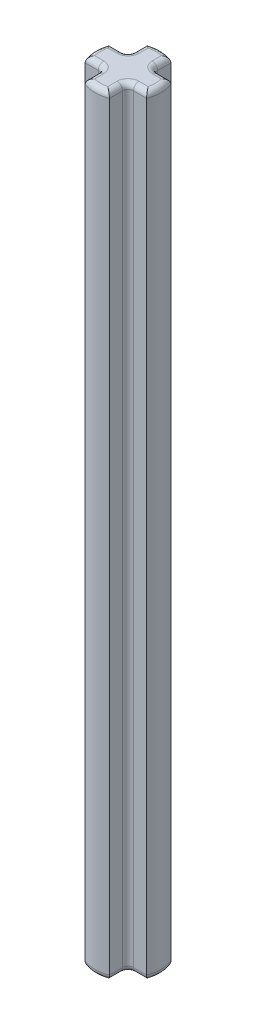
ISO-10303-21;
HEADER;
FILE_DESCRIPTION(('STEP AP214'),'2;1');
FILE_NAME('part.step','',(''),(''),'','','');
FILE_SCHEMA(('AUTOMOTIVE_DESIGN { 1 0 10303 214 1 1 1 1 }'));
ENDSEC;
DATA;
#1=APPLICATION_CONTEXT('core data for automotive mechanical design processes');
#2=APPLICATION_PROTOCOL_DEFINITION('international standard','automotive_design',2000,#1);
#3=PRODUCT_CONTEXT('',#1,'mechanical');
#4=PRODUCT('Part','Part','',(#3));
#5=PRODUCT_RELATED_PRODUCT_CATEGORY('part','',(#4));
#6=PRODUCT_DEFINITION_FORMATION('','',#4);
#7=PRODUCT_DEFINITION_CONTEXT('part definition',#1,'design');
#8=PRODUCT_DEFINITION('design','',#6,#7);
#9=PRODUCT_DEFINITION_SHAPE('','',#8);
#10=(LENGTH_UNIT() NAMED_UNIT(*) SI_UNIT(.MILLI.,.METRE.));
#11=(NAMED_UNIT(*) PLANE_ANGLE_UNIT() SI_UNIT($,.RADIAN.));
#12=(NAMED_UNIT(*) SI_UNIT($,.STERADIAN.) SOLID_ANGLE_UNIT());
#13=UNCERTAINTY_MEASURE_WITH_UNIT(LENGTH_MEASURE(1.E-05),#10,'distance_accuracy_value','');
#14=(GEOMETRIC_REPRESENTATION_CONTEXT(3) GLOBAL_UNCERTAINTY_ASSIGNED_CONTEXT((#13)) GLOBAL_UNIT_ASSIGNED_CONTEXT((#10,
#11,#12)) REPRESENTATION_CONTEXT('',''));
#15=CARTESIAN_POINT('',(0.,0.,0.));
#16=DIRECTION('',(0.,0.,1.));
#17=DIRECTION('',(1.,0.,0.));
#18=AXIS2_PLACEMENT_3D('',#15,#16,#17);
#19=CARTESIAN_POINT('',(0.,56.,0.));
#20=DIRECTION('',(0.,-1.,0.));
#21=DIRECTION('',(1.,0.,0.));
#22=AXIS2_PLACEMENT_3D('',#19,#20,#21);
#23=CYLINDRICAL_SURFACE('',#22,2.4);
#24=DIRECTION('',(0.,1.,0.));
#25=VECTOR('',#24,1.);
#26=CARTESIAN_POINT('',(-0.880000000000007,0.,2.23284571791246));
#27=LINE('',#26,#25);
#28=CARTESIAN_POINT('',(-0.880000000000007,0.4,2.23284571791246));
#29=VERTEX_POINT('',#28);
#30=CARTESIAN_POINT('',(-0.880000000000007,55.6,2.23284571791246));
#31=VERTEX_POINT('',#30);
#32=EDGE_CURVE('E267',#29,#31,#27,.T.);
#33=ORIENTED_EDGE('',*,*,#32,.F.);
#34=CARTESIAN_POINT('',(0.,0.399999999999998,0.));
#35=DIRECTION('',(0.,-1.,0.));
#36=DIRECTION('',(1.,0.,0.));
#37=AXIS2_PLACEMENT_3D('',#34,#35,#36);
#38=CIRCLE('',#37,2.4);
#39=CARTESIAN_POINT('',(0.879999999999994,0.399999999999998,2.23284571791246));
#40=VERTEX_POINT('',#39);
#41=EDGE_CURVE('E356',#29,#40,#38,.F.);
#42=ORIENTED_EDGE('',*,*,#41,.T.);
#43=DIRECTION('',(0.,1.,0.));
#44=VECTOR('',#43,1.);
#45=CARTESIAN_POINT('',(0.879999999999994,0.,2.23284571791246));
#46=LINE('',#45,#44);
#47=CARTESIAN_POINT('',(0.879999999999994,55.6,2.23284571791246));
#48=VERTEX_POINT('',#47);
#49=EDGE_CURVE('E763',#40,#48,#46,.T.);
#50=ORIENTED_EDGE('',*,*,#49,.T.);
#51=CARTESIAN_POINT('',(0.,55.6,0.));
#52=DIRECTION('',(0.,1.,0.));
#53=DIRECTION('',(-1.,0.,0.));
#54=AXIS2_PLACEMENT_3D('',#51,#52,#53);
#55=CIRCLE('',#54,2.4);
#56=EDGE_CURVE('E354',#48,#31,#55,.F.);
#57=ORIENTED_EDGE('',*,*,#56,.T.);
#58=EDGE_LOOP('',(#33,#42,#50,#57));
#59=FACE_BOUND('',#58,.T.);
#60=ADVANCED_FACE('F32',(#59),#23,.T.);
#61=DIRECTION('',(0.,1.,0.));
#62=VECTOR('',#61,1.);
#63=CARTESIAN_POINT('',(2.23284571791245,0.,0.880000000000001));
#64=LINE('',#63,#62);
#65=CARTESIAN_POINT('',(2.23284571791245,0.4,0.880000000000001));
#66=VERTEX_POINT('',#65);
#67=CARTESIAN_POINT('',(2.23284571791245,55.6,0.880000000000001));
#68=VERTEX_POINT('',#67);
#69=EDGE_CURVE('E761',#66,#68,#64,.T.);
#70=ORIENTED_EDGE('',*,*,#69,.F.);
#71=CARTESIAN_POINT('',(0.,0.399999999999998,0.));
#72=DIRECTION('',(0.,-1.,0.));
#73=DIRECTION('',(1.,0.,0.));
#74=AXIS2_PLACEMENT_3D('',#71,#72,#73);
#75=CIRCLE('',#74,2.4);
#76=CARTESIAN_POINT('',(2.23284571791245,0.399999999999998,-0.88));
#77=VERTEX_POINT('',#76);
#78=EDGE_CURVE('E318',#66,#77,#75,.F.);
#79=ORIENTED_EDGE('',*,*,#78,.T.);
#80=DIRECTION('',(0.,1.,0.));
#81=VECTOR('',#80,1.);
#82=CARTESIAN_POINT('',(2.23284571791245,0.,-0.88));
#83=LINE('',#82,#81);
#84=CARTESIAN_POINT('',(2.23284571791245,55.6,-0.88));
#85=VERTEX_POINT('',#84);
#86=EDGE_CURVE('E683',#77,#85,#83,.T.);
#87=ORIENTED_EDGE('',*,*,#86,.T.);
#88=CARTESIAN_POINT('',(0.,55.6,0.));
#89=DIRECTION('',(0.,1.,0.));
#90=DIRECTION('',(-1.,0.,0.));
#91=AXIS2_PLACEMENT_3D('',#88,#89,#90);
#92=CIRCLE('',#91,2.4);
#93=EDGE_CURVE('E316',#85,#68,#92,.F.);
#94=ORIENTED_EDGE('',*,*,#93,.T.);
#95=EDGE_LOOP('',(#70,#79,#87,#94));
#96=FACE_BOUND('',#95,.T.);
#97=ADVANCED_FACE('F656',(#96),#23,.T.);
#98=DIRECTION('',(0.,1.,0.));
#99=VECTOR('',#98,1.);
#100=CARTESIAN_POINT('',(0.879999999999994,0.,-2.23284571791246));
#101=LINE('',#100,#99);
#102=CARTESIAN_POINT('',(0.879999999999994,0.399999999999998,-2.23284571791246));
#103=VERTEX_POINT('',#102);
#104=CARTESIAN_POINT('',(0.879999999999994,55.6,-2.23284571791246));
#105=VERTEX_POINT('',#104);
#106=EDGE_CURVE('E768',#103,#105,#101,.T.);
#107=ORIENTED_EDGE('',*,*,#106,.F.);
#108=CARTESIAN_POINT('',(0.,0.399999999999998,0.));
#109=DIRECTION('',(0.,-1.,0.));
#110=DIRECTION('',(1.,0.,0.));
#111=AXIS2_PLACEMENT_3D('',#108,#109,#110);
#112=CIRCLE('',#111,2.4);
#113=CARTESIAN_POINT('',(-0.880000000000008,0.4,-2.23284571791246));
#114=VERTEX_POINT('',#113);
#115=EDGE_CURVE('E322',#103,#114,#112,.F.);
#116=ORIENTED_EDGE('',*,*,#115,.T.);
#117=DIRECTION('',(0.,1.,0.));
#118=VECTOR('',#117,1.);
#119=CARTESIAN_POINT('',(-0.880000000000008,0.,-2.23284571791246));
#120=LINE('',#119,#118);
#121=CARTESIAN_POINT('',(-0.880000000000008,55.6,-2.23284571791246));
#122=VERTEX_POINT('',#121);
#123=EDGE_CURVE('E682',#114,#122,#120,.T.);
#124=ORIENTED_EDGE('',*,*,#123,.T.);
#125=CARTESIAN_POINT('',(0.,55.6,0.));
#126=DIRECTION('',(0.,1.,0.));
#127=DIRECTION('',(-1.,0.,0.));
#128=AXIS2_PLACEMENT_3D('',#125,#126,#127);
#129=CIRCLE('',#128,2.4);
#130=EDGE_CURVE('E320',#122,#105,#129,.F.);
#131=ORIENTED_EDGE('',*,*,#130,.T.);
#132=EDGE_LOOP('',(#107,#116,#124,#131));
#133=FACE_BOUND('',#132,.T.);
#134=ADVANCED_FACE('F662',(#133),#23,.T.);
#135=DIRECTION('',(0.,1.,0.));
#136=VECTOR('',#135,1.);
#137=CARTESIAN_POINT('',(-2.23284571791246,0.,-0.88));
#138=LINE('',#137,#136);
#139=CARTESIAN_POINT('',(-2.23284571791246,0.4,-0.88));
#140=VERTEX_POINT('',#139);
#141=CARTESIAN_POINT('',(-2.23284571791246,55.6,-0.88));
#142=VERTEX_POINT('',#141);
#143=EDGE_CURVE('E676',#140,#142,#138,.T.);
#144=ORIENTED_EDGE('',*,*,#143,.F.);
#145=CARTESIAN_POINT('',(0.,0.399999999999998,0.));
#146=DIRECTION('',(0.,-1.,0.));
#147=DIRECTION('',(1.,0.,0.));
#148=AXIS2_PLACEMENT_3D('',#145,#146,#147);
#149=CIRCLE('',#148,2.4);
#150=CARTESIAN_POINT('',(-2.23284571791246,0.4,0.880000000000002));
#151=VERTEX_POINT('',#150);
#152=EDGE_CURVE('E345',#140,#151,#149,.F.);
#153=ORIENTED_EDGE('',*,*,#152,.T.);
#154=DIRECTION('',(0.,1.,0.));
#155=VECTOR('',#154,1.);
#156=CARTESIAN_POINT('',(-2.23284571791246,0.,0.880000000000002));
#157=LINE('',#156,#155);
#158=CARTESIAN_POINT('',(-2.23284571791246,55.6,0.880000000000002));
#159=VERTEX_POINT('',#158);
#160=EDGE_CURVE('E264',#151,#159,#157,.T.);
#161=ORIENTED_EDGE('',*,*,#160,.T.);
#162=CARTESIAN_POINT('',(0.,55.6,0.));
#163=DIRECTION('',(0.,1.,0.));
#164=DIRECTION('',(-1.,0.,0.));
#165=AXIS2_PLACEMENT_3D('',#162,#163,#164);
#166=CIRCLE('',#165,2.4);
#167=EDGE_CURVE('E343',#159,#142,#166,.F.);
#168=ORIENTED_EDGE('',*,*,#167,.T.);
#169=EDGE_LOOP('',(#144,#153,#161,#168));
#170=FACE_BOUND('',#169,.T.);
#171=ADVANCED_FACE('F658',(#170),#23,.T.);
#172=CARTESIAN_POINT('',(2.4,56.,0.));
#173=DIRECTION('',(0.,1.,0.));
#174=DIRECTION('',(-1.,0.,0.));
#175=AXIS2_PLACEMENT_3D('',#172,#173,#174);
#176=PLANE('',#175);
#177=CARTESIAN_POINT('',(0.,56.,0.));
#178=DIRECTION('',(0.,1.,0.));
#179=DIRECTION('',(-1.,0.,0.));
#180=AXIS2_PLACEMENT_3D('',#177,#178,#179);
#181=CIRCLE('',#180,2.);
#182=CARTESIAN_POINT('',(1.94154577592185,56.,0.480000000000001));
#183=VERTEX_POINT('',#182);
#184=CARTESIAN_POINT('',(1.94154577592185,56.,-0.48));
#185=VERTEX_POINT('',#184);
#186=EDGE_CURVE('E398',#183,#185,#181,.T.);
#187=ORIENTED_EDGE('',*,*,#186,.T.);
#188=DIRECTION('',(1.,0.,0.));
#189=VECTOR('',#188,1.);
#190=CARTESIAN_POINT('',(0.879999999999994,56.,-0.48));
#191=LINE('',#190,#189);
#192=CARTESIAN_POINT('',(1.27999999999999,56.,-0.48));
#193=VERTEX_POINT('',#192);
#194=EDGE_CURVE('E11',#185,#193,#191,.F.);
#195=ORIENTED_EDGE('',*,*,#194,.T.);
#196=CARTESIAN_POINT('',(1.27999999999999,56.,-1.28));
#197=DIRECTION('',(0.,1.,0.));
#198=DIRECTION('',(-1.,0.,0.));
#199=AXIS2_PLACEMENT_3D('',#196,#197,#198);
#200=CIRCLE('',#199,0.8);
#201=CARTESIAN_POINT('',(0.479999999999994,56.,-1.28));
#202=VERTEX_POINT('',#201);
#203=EDGE_CURVE('E41',#202,#193,#200,.T.);
#204=ORIENTED_EDGE('',*,*,#203,.F.);
#205=DIRECTION('',(0.,0.,1.));
#206=VECTOR('',#205,1.);
#207=CARTESIAN_POINT('',(0.479999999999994,56.,-2.23284571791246));
#208=LINE('',#207,#206);
#209=CARTESIAN_POINT('',(0.479999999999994,56.,-1.94154577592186));
#210=VERTEX_POINT('',#209);
#211=EDGE_CURVE('E400',#202,#210,#208,.F.);
#212=ORIENTED_EDGE('',*,*,#211,.T.);
#213=CARTESIAN_POINT('',(0.,56.,0.));
#214=DIRECTION('',(0.,1.,0.));
#215=DIRECTION('',(-1.,0.,0.));
#216=AXIS2_PLACEMENT_3D('',#213,#214,#215);
#217=CIRCLE('',#216,2.);
#218=CARTESIAN_POINT('',(-0.480000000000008,56.,-1.94154577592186));
#219=VERTEX_POINT('',#218);
#220=EDGE_CURVE('E390',#210,#219,#217,.T.);
#221=ORIENTED_EDGE('',*,*,#220,.T.);
#222=DIRECTION('',(0.,0.,-1.));
#223=VECTOR('',#222,1.);
#224=CARTESIAN_POINT('',(-0.480000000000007,56.,-0.88));
#225=LINE('',#224,#223);
#226=CARTESIAN_POINT('',(-0.480000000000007,56.,-1.28));
#227=VERTEX_POINT('',#226);
#228=EDGE_CURVE('E388',#219,#227,#225,.F.);
#229=ORIENTED_EDGE('',*,*,#228,.T.);
#230=CARTESIAN_POINT('',(-1.28000000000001,56.,-1.28));
#231=DIRECTION('',(0.,1.,0.));
#232=DIRECTION('',(-1.,0.,0.));
#233=AXIS2_PLACEMENT_3D('',#230,#231,#232);
#234=CIRCLE('',#233,0.8);
#235=CARTESIAN_POINT('',(-1.28000000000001,56.,-0.48));
#236=VERTEX_POINT('',#235);
#237=EDGE_CURVE('E385',#236,#227,#234,.T.);
#238=ORIENTED_EDGE('',*,*,#237,.F.);
#239=DIRECTION('',(1.,0.,0.));
#240=VECTOR('',#239,1.);
#241=CARTESIAN_POINT('',(-2.23284571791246,56.,-0.48));
#242=LINE('',#241,#240);
#243=CARTESIAN_POINT('',(-1.94154577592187,56.,-0.48));
#244=VERTEX_POINT('',#243);
#245=EDGE_CURVE('E383',#236,#244,#242,.F.);
#246=ORIENTED_EDGE('',*,*,#245,.T.);
#247=CARTESIAN_POINT('',(0.,56.,0.));
#248=DIRECTION('',(0.,1.,0.));
#249=DIRECTION('',(-1.,0.,0.));
#250=AXIS2_PLACEMENT_3D('',#247,#248,#249);
#251=CIRCLE('',#250,2.);
#252=CARTESIAN_POINT('',(-1.94154577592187,56.,0.480000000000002));
#253=VERTEX_POINT('',#252);
#254=EDGE_CURVE('E381',#244,#253,#251,.T.);
#255=ORIENTED_EDGE('',*,*,#254,.T.);
#256=DIRECTION('',(-1.,0.,0.));
#257=VECTOR('',#256,1.);
#258=CARTESIAN_POINT('',(-0.880000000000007,56.,0.480000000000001));
#259=LINE('',#258,#257);
#260=CARTESIAN_POINT('',(-1.28000000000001,56.,0.480000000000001));
#261=VERTEX_POINT('',#260);
#262=EDGE_CURVE('E379',#253,#261,#259,.F.);
#263=ORIENTED_EDGE('',*,*,#262,.T.);
#264=CARTESIAN_POINT('',(-1.28000000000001,56.,1.28));
#265=DIRECTION('',(0.,1.,0.));
#266=DIRECTION('',(-1.,0.,0.));
#267=AXIS2_PLACEMENT_3D('',#264,#265,#266);
#268=CIRCLE('',#267,0.8);
#269=CARTESIAN_POINT('',(-0.480000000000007,56.,1.28));
#270=VERTEX_POINT('',#269);
#271=EDGE_CURVE('E376',#270,#261,#268,.T.);
#272=ORIENTED_EDGE('',*,*,#271,.F.);
#273=DIRECTION('',(0.,0.,-1.));
#274=VECTOR('',#273,1.);
#275=CARTESIAN_POINT('',(-0.480000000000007,56.,2.23284571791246));
#276=LINE('',#275,#274);
#277=CARTESIAN_POINT('',(-0.480000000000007,56.,1.94154577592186));
#278=VERTEX_POINT('',#277);
#279=EDGE_CURVE('E374',#270,#278,#276,.F.);
#280=ORIENTED_EDGE('',*,*,#279,.T.);
#281=CARTESIAN_POINT('',(0.,56.,0.));
#282=DIRECTION('',(0.,1.,0.));
#283=DIRECTION('',(-1.,0.,0.));
#284=AXIS2_PLACEMENT_3D('',#281,#282,#283);
#285=CIRCLE('',#284,2.);
#286=CARTESIAN_POINT('',(0.479999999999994,56.,1.94154577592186));
#287=VERTEX_POINT('',#286);
#288=EDGE_CURVE('E370',#278,#287,#285,.T.);
#289=ORIENTED_EDGE('',*,*,#288,.T.);
#290=DIRECTION('',(0.,0.,1.));
#291=VECTOR('',#290,1.);
#292=CARTESIAN_POINT('',(0.479999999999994,56.,0.880000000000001));
#293=LINE('',#292,#291);
#294=CARTESIAN_POINT('',(0.479999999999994,56.,1.28));
#295=VERTEX_POINT('',#294);
#296=EDGE_CURVE('E372',#287,#295,#293,.F.);
#297=ORIENTED_EDGE('',*,*,#296,.T.);
#298=CARTESIAN_POINT('',(1.27999999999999,56.,1.28));
#299=DIRECTION('',(0.,1.,0.));
#300=DIRECTION('',(-1.,0.,0.));
#301=AXIS2_PLACEMENT_3D('',#298,#299,#300);
#302=CIRCLE('',#301,0.8);
#303=CARTESIAN_POINT('',(1.27999999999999,56.,0.480000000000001));
#304=VERTEX_POINT('',#303);
#305=EDGE_CURVE('E393',#304,#295,#302,.T.);
#306=ORIENTED_EDGE('',*,*,#305,.F.);
#307=DIRECTION('',(-1.,0.,0.));
#308=VECTOR('',#307,1.);
#309=CARTESIAN_POINT('',(2.23284571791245,56.,0.480000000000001));
#310=LINE('',#309,#308);
#311=EDGE_CURVE('E396',#304,#183,#310,.F.);
#312=ORIENTED_EDGE('',*,*,#311,.T.);
#313=EDGE_LOOP('',(#187,#195,#204,#212,#221,#229,#238,#246,#255,#263,#272,#280,#289,#297,#306,#312));
#314=FACE_BOUND('',#313,.T.);
#315=ADVANCED_FACE('F667',(#314),#176,.T.);
#316=CARTESIAN_POINT('',(0.,0.,0.));
#317=DIRECTION('',(0.,-1.,0.));
#318=DIRECTION('',(1.,0.,0.));
#319=AXIS2_PLACEMENT_3D('',#316,#317,#318);
#320=PLANE('',#319);
#321=CARTESIAN_POINT('',(-1.28000000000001,0.,-1.28));
#322=DIRECTION('',(0.,-1.,0.));
#323=DIRECTION('',(1.,0.,0.));
#324=AXIS2_PLACEMENT_3D('',#321,#322,#323);
#325=CIRCLE('',#324,0.8);
#326=CARTESIAN_POINT('',(-0.480000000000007,0.,-1.28));
#327=VERTEX_POINT('',#326);
#328=CARTESIAN_POINT('',(-1.28000000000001,0.,-0.48));
#329=VERTEX_POINT('',#328);
#330=EDGE_CURVE('E297',#327,#329,#325,.T.);
#331=ORIENTED_EDGE('',*,*,#330,.F.);
#332=DIRECTION('',(0.,0.,-1.));
#333=VECTOR('',#332,1.);
#334=CARTESIAN_POINT('',(-0.480000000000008,0.,-2.23284571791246));
#335=LINE('',#334,#333);
#336=CARTESIAN_POINT('',(-0.480000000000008,0.,-1.94154577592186));
#337=VERTEX_POINT('',#336);
#338=EDGE_CURVE('E300',#327,#337,#335,.T.);
#339=ORIENTED_EDGE('',*,*,#338,.T.);
#340=CARTESIAN_POINT('',(0.,0.,0.));
#341=DIRECTION('',(0.,-1.,0.));
#342=DIRECTION('',(1.,0.,0.));
#343=AXIS2_PLACEMENT_3D('',#340,#341,#342);
#344=CIRCLE('',#343,2.);
#345=CARTESIAN_POINT('',(0.479999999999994,0.,-1.94154577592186));
#346=VERTEX_POINT('',#345);
#347=EDGE_CURVE('E295',#337,#346,#344,.T.);
#348=ORIENTED_EDGE('',*,*,#347,.T.);
#349=DIRECTION('',(0.,0.,1.));
#350=VECTOR('',#349,1.);
#351=CARTESIAN_POINT('',(0.479999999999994,0.,-0.88));
#352=LINE('',#351,#350);
#353=CARTESIAN_POINT('',(0.479999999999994,0.,-1.28));
#354=VERTEX_POINT('',#353);
#355=EDGE_CURVE('E290',#346,#354,#352,.T.);
#356=ORIENTED_EDGE('',*,*,#355,.T.);
#357=CARTESIAN_POINT('',(1.27999999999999,0.,-1.28));
#358=DIRECTION('',(0.,-1.,0.));
#359=DIRECTION('',(1.,0.,0.));
#360=AXIS2_PLACEMENT_3D('',#357,#358,#359);
#361=CIRCLE('',#360,0.8);
#362=CARTESIAN_POINT('',(1.27999999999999,0.,-0.48));
#363=VERTEX_POINT('',#362);
#364=EDGE_CURVE('E287',#363,#354,#361,.T.);
#365=ORIENTED_EDGE('',*,*,#364,.F.);
#366=DIRECTION('',(1.,0.,0.));
#367=VECTOR('',#366,1.);
#368=CARTESIAN_POINT('',(2.23284571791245,0.,-0.48));
#369=LINE('',#368,#367);
#370=CARTESIAN_POINT('',(1.94154577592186,0.,-0.48));
#371=VERTEX_POINT('',#370);
#372=EDGE_CURVE('E285',#363,#371,#369,.T.);
#373=ORIENTED_EDGE('',*,*,#372,.T.);
#374=CARTESIAN_POINT('',(0.,0.,0.));
#375=DIRECTION('',(0.,-1.,0.));
#376=DIRECTION('',(1.,0.,0.));
#377=AXIS2_PLACEMENT_3D('',#374,#375,#376);
#378=CIRCLE('',#377,2.);
#379=CARTESIAN_POINT('',(1.94154577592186,0.,0.480000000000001));
#380=VERTEX_POINT('',#379);
#381=EDGE_CURVE('E283',#371,#380,#378,.T.);
#382=ORIENTED_EDGE('',*,*,#381,.T.);
#383=DIRECTION('',(-1.,0.,0.));
#384=VECTOR('',#383,1.);
#385=CARTESIAN_POINT('',(0.879999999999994,0.,0.480000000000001));
#386=LINE('',#385,#384);
#387=CARTESIAN_POINT('',(1.27999999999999,0.,0.480000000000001));
#388=VERTEX_POINT('',#387);
#389=EDGE_CURVE('E281',#380,#388,#386,.T.);
#390=ORIENTED_EDGE('',*,*,#389,.T.);
#391=CARTESIAN_POINT('',(1.27999999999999,0.,1.28));
#392=DIRECTION('',(0.,-1.,0.));
#393=DIRECTION('',(1.,0.,0.));
#394=AXIS2_PLACEMENT_3D('',#391,#392,#393);
#395=CIRCLE('',#394,0.8);
#396=CARTESIAN_POINT('',(0.479999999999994,0.,1.28));
#397=VERTEX_POINT('',#396);
#398=EDGE_CURVE('E278',#397,#388,#395,.T.);
#399=ORIENTED_EDGE('',*,*,#398,.F.);
#400=DIRECTION('',(0.,0.,1.));
#401=VECTOR('',#400,1.);
#402=CARTESIAN_POINT('',(0.479999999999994,0.,2.23284571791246));
#403=LINE('',#402,#401);
#404=CARTESIAN_POINT('',(0.479999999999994,0.,1.94154577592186));
#405=VERTEX_POINT('',#404);
#406=EDGE_CURVE('E276',#397,#405,#403,.T.);
#407=ORIENTED_EDGE('',*,*,#406,.T.);
#408=CARTESIAN_POINT('',(0.,0.,0.));
#409=DIRECTION('',(0.,-1.,0.));
#410=DIRECTION('',(1.,0.,0.));
#411=AXIS2_PLACEMENT_3D('',#408,#409,#410);
#412=CIRCLE('',#411,2.);
#413=CARTESIAN_POINT('',(-0.480000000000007,0.,1.94154577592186));
#414=VERTEX_POINT('',#413);
#415=EDGE_CURVE('E272',#405,#414,#412,.T.);
#416=ORIENTED_EDGE('',*,*,#415,.T.);
#417=DIRECTION('',(0.,0.,-1.));
#418=VECTOR('',#417,1.);
#419=CARTESIAN_POINT('',(-0.480000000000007,0.,0.880000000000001));
#420=LINE('',#419,#418);
#421=CARTESIAN_POINT('',(-0.480000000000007,0.,1.28));
#422=VERTEX_POINT('',#421);
#423=EDGE_CURVE('E245',#414,#422,#420,.T.);
#424=ORIENTED_EDGE('',*,*,#423,.T.);
#425=CARTESIAN_POINT('',(-1.28000000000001,0.,1.28));
#426=DIRECTION('',(0.,-1.,0.));
#427=DIRECTION('',(1.,0.,0.));
#428=AXIS2_PLACEMENT_3D('',#425,#426,#427);
#429=CIRCLE('',#428,0.8);
#430=CARTESIAN_POINT('',(-1.28000000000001,0.,0.480000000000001));
#431=VERTEX_POINT('',#430);
#432=EDGE_CURVE('E238',#431,#422,#429,.T.);
#433=ORIENTED_EDGE('',*,*,#432,.F.);
#434=DIRECTION('',(-1.,0.,0.));
#435=VECTOR('',#434,1.);
#436=CARTESIAN_POINT('',(-2.23284571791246,0.,0.480000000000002));
#437=LINE('',#436,#435);
#438=CARTESIAN_POINT('',(-1.94154577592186,0.,0.480000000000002));
#439=VERTEX_POINT('',#438);
#440=EDGE_CURVE('E242',#431,#439,#437,.T.);
#441=ORIENTED_EDGE('',*,*,#440,.T.);
#442=CARTESIAN_POINT('',(0.,0.,0.));
#443=DIRECTION('',(0.,-1.,0.));
#444=DIRECTION('',(1.,0.,0.));
#445=AXIS2_PLACEMENT_3D('',#442,#443,#444);
#446=CIRCLE('',#445,2.);
#447=CARTESIAN_POINT('',(-1.94154577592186,0.,-0.48));
#448=VERTEX_POINT('',#447);
#449=EDGE_CURVE('E274',#439,#448,#446,.T.);
#450=ORIENTED_EDGE('',*,*,#449,.T.);
#451=DIRECTION('',(1.,0.,0.));
#452=VECTOR('',#451,1.);
#453=CARTESIAN_POINT('',(-0.880000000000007,0.,-0.48));
#454=LINE('',#453,#452);
#455=EDGE_CURVE('E293',#448,#329,#454,.T.);
#456=ORIENTED_EDGE('',*,*,#455,.T.);
#457=EDGE_LOOP('',(#331,#339,#348,#356,#365,#373,#382,#390,#399,#407,#416,#424,#433,#441,#450,#456));
#458=FACE_BOUND('',#457,.T.);
#459=ADVANCED_FACE('F240',(#458),#320,.T.);
#460=CARTESIAN_POINT('',(-0.880000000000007,0.,0.880000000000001));
#461=DIRECTION('',(0.,0.,-1.));
#462=DIRECTION('',(-1.,0.,0.));
#463=AXIS2_PLACEMENT_3D('',#460,#461,#462);
#464=PLANE('',#463);
#465=ORIENTED_EDGE('',*,*,#160,.F.);
#466=DIRECTION('',(-1.,0.,0.));
#467=VECTOR('',#466,1.);
#468=CARTESIAN_POINT('',(-0.880000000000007,0.4,0.880000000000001));
#469=LINE('',#468,#467);
#470=CARTESIAN_POINT('',(-1.28000000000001,0.4,0.880000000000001));
#471=VERTEX_POINT('',#470);
#472=EDGE_CURVE('E368',#151,#471,#469,.F.);
#473=ORIENTED_EDGE('',*,*,#472,.T.);
#474=DIRECTION('',(0.,1.,0.));
#475=VECTOR('',#474,1.);
#476=CARTESIAN_POINT('',(-1.28000000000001,56.,0.880000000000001));
#477=LINE('',#476,#475);
#478=CARTESIAN_POINT('',(-1.28000000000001,55.6,0.880000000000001));
#479=VERTEX_POINT('',#478);
#480=EDGE_CURVE('E364',#471,#479,#477,.T.);
#481=ORIENTED_EDGE('',*,*,#480,.T.);
#482=DIRECTION('',(-1.,0.,0.));
#483=VECTOR('',#482,1.);
#484=CARTESIAN_POINT('',(-2.23284571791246,55.6,0.880000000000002));
#485=LINE('',#484,#483);
#486=EDGE_CURVE('E366',#479,#159,#485,.T.);
#487=ORIENTED_EDGE('',*,*,#486,.T.);
#488=EDGE_LOOP('',(#465,#473,#481,#487));
#489=FACE_BOUND('',#488,.T.);
#490=ADVANCED_FACE('F788',(#489),#464,.F.);
#491=CARTESIAN_POINT('',(-0.880000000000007,0.,2.23284571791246));
#492=DIRECTION('',(1.,0.,0.));
#493=DIRECTION('',(0.,0.,-1.));
#494=AXIS2_PLACEMENT_3D('',#491,#492,#493);
#495=PLANE('',#494);
#496=DIRECTION('',(0.,1.,0.));
#497=VECTOR('',#496,1.);
#498=CARTESIAN_POINT('',(-0.880000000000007,0.,1.28));
#499=LINE('',#498,#497);
#500=CARTESIAN_POINT('',(-0.880000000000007,55.6,1.28));
#501=VERTEX_POINT('',#500);
#502=CARTESIAN_POINT('',(-0.880000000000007,0.4,1.28));
#503=VERTEX_POINT('',#502);
#504=EDGE_CURVE('E358',#501,#503,#499,.F.);
#505=ORIENTED_EDGE('',*,*,#504,.T.);
#506=DIRECTION('',(0.,0.,-1.));
#507=VECTOR('',#506,1.);
#508=CARTESIAN_POINT('',(-0.880000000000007,0.4,2.23284571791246));
#509=LINE('',#508,#507);
#510=EDGE_CURVE('E362',#503,#29,#509,.F.);
#511=ORIENTED_EDGE('',*,*,#510,.T.);
#512=ORIENTED_EDGE('',*,*,#32,.T.);
#513=DIRECTION('',(0.,0.,-1.));
#514=VECTOR('',#513,1.);
#515=CARTESIAN_POINT('',(-0.880000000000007,55.6,0.880000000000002));
#516=LINE('',#515,#514);
#517=EDGE_CURVE('E360',#31,#501,#516,.T.);
#518=ORIENTED_EDGE('',*,*,#517,.T.);
#519=EDGE_LOOP('',(#505,#511,#512,#518));
#520=FACE_BOUND('',#519,.T.);
#521=ADVANCED_FACE('F780',(#520),#495,.F.);
#522=CARTESIAN_POINT('',(-0.880000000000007,0.,-0.88));
#523=DIRECTION('',(1.,0.,0.));
#524=DIRECTION('',(0.,0.,-1.));
#525=AXIS2_PLACEMENT_3D('',#522,#523,#524);
#526=PLANE('',#525);
#527=ORIENTED_EDGE('',*,*,#123,.F.);
#528=DIRECTION('',(0.,0.,-1.));
#529=VECTOR('',#528,1.);
#530=CARTESIAN_POINT('',(-0.880000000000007,0.4,-0.88));
#531=LINE('',#530,#529);
#532=CARTESIAN_POINT('',(-0.880000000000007,0.4,-1.28));
#533=VERTEX_POINT('',#532);
#534=EDGE_CURVE('E341',#114,#533,#531,.F.);
#535=ORIENTED_EDGE('',*,*,#534,.T.);
#536=DIRECTION('',(0.,1.,0.));
#537=VECTOR('',#536,1.);
#538=CARTESIAN_POINT('',(-0.880000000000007,56.,-1.28));
#539=LINE('',#538,#537);
#540=CARTESIAN_POINT('',(-0.880000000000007,55.6,-1.28));
#541=VERTEX_POINT('',#540);
#542=EDGE_CURVE('E337',#533,#541,#539,.T.);
#543=ORIENTED_EDGE('',*,*,#542,.T.);
#544=DIRECTION('',(0.,0.,-1.));
#545=VECTOR('',#544,1.);
#546=CARTESIAN_POINT('',(-0.880000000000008,55.6,-2.23284571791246));
#547=LINE('',#546,#545);
#548=EDGE_CURVE('E339',#541,#122,#547,.T.);
#549=ORIENTED_EDGE('',*,*,#548,.T.);
#550=EDGE_LOOP('',(#527,#535,#543,#549));
#551=FACE_BOUND('',#550,.T.);
#552=ADVANCED_FACE('F795',(#551),#526,.F.);
#553=CARTESIAN_POINT('',(-2.23284571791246,0.,-0.88));
#554=DIRECTION('',(0.,0.,1.));
#555=DIRECTION('',(1.,0.,0.));
#556=AXIS2_PLACEMENT_3D('',#553,#554,#555);
#557=PLANE('',#556);
#558=DIRECTION('',(0.,1.,0.));
#559=VECTOR('',#558,1.);
#560=CARTESIAN_POINT('',(-1.28000000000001,0.,-0.88));
#561=LINE('',#560,#559);
#562=CARTESIAN_POINT('',(-1.28000000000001,55.6,-0.88));
#563=VERTEX_POINT('',#562);
#564=CARTESIAN_POINT('',(-1.28000000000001,0.4,-0.88));
#565=VERTEX_POINT('',#564);
#566=EDGE_CURVE('E348',#563,#565,#561,.F.);
#567=ORIENTED_EDGE('',*,*,#566,.T.);
#568=DIRECTION('',(1.,0.,0.));
#569=VECTOR('',#568,1.);
#570=CARTESIAN_POINT('',(-2.23284571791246,0.4,-0.88));
#571=LINE('',#570,#569);
#572=EDGE_CURVE('E352',#565,#140,#571,.F.);
#573=ORIENTED_EDGE('',*,*,#572,.T.);
#574=ORIENTED_EDGE('',*,*,#143,.T.);
#575=DIRECTION('',(1.,0.,0.));
#576=VECTOR('',#575,1.);
#577=CARTESIAN_POINT('',(-0.880000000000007,55.6,-0.88));
#578=LINE('',#577,#576);
#579=EDGE_CURVE('E350',#142,#563,#578,.T.);
#580=ORIENTED_EDGE('',*,*,#579,.T.);
#581=EDGE_LOOP('',(#567,#573,#574,#580));
#582=FACE_BOUND('',#581,.T.);
#583=ADVANCED_FACE('F799',(#582),#557,.F.);
#584=CARTESIAN_POINT('',(0.879999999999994,0.,-0.88));
#585=DIRECTION('',(0.,0.,1.));
#586=DIRECTION('',(1.,0.,0.));
#587=AXIS2_PLACEMENT_3D('',#584,#585,#586);
#588=PLANE('',#587);
#589=ORIENTED_EDGE('',*,*,#86,.F.);
#590=DIRECTION('',(1.,0.,0.));
#591=VECTOR('',#590,1.);
#592=CARTESIAN_POINT('',(0.879999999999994,0.4,-0.88));
#593=LINE('',#592,#591);
#594=CARTESIAN_POINT('',(1.27999999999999,0.4,-0.88));
#595=VERTEX_POINT('',#594);
#596=EDGE_CURVE('E313',#77,#595,#593,.F.);
#597=ORIENTED_EDGE('',*,*,#596,.T.);
#598=DIRECTION('',(0.,1.,0.));
#599=VECTOR('',#598,1.);
#600=CARTESIAN_POINT('',(1.27999999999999,56.,-0.88));
#601=LINE('',#600,#599);
#602=CARTESIAN_POINT('',(1.27999999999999,55.6,-0.88));
#603=VERTEX_POINT('',#602);
#604=EDGE_CURVE('E309',#595,#603,#601,.T.);
#605=ORIENTED_EDGE('',*,*,#604,.T.);
#606=DIRECTION('',(1.,0.,0.));
#607=VECTOR('',#606,1.);
#608=CARTESIAN_POINT('',(2.23284571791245,55.6,-0.88));
#609=LINE('',#608,#607);
#610=EDGE_CURVE('E311',#603,#85,#609,.T.);
#611=ORIENTED_EDGE('',*,*,#610,.T.);
#612=EDGE_LOOP('',(#589,#597,#605,#611));
#613=FACE_BOUND('',#612,.T.);
#614=ADVANCED_FACE('F802',(#613),#588,.F.);
#615=CARTESIAN_POINT('',(0.879999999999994,0.,-2.23284571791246));
#616=DIRECTION('',(-1.,0.,0.));
#617=DIRECTION('',(0.,0.,1.));
#618=AXIS2_PLACEMENT_3D('',#615,#616,#617);
#619=PLANE('',#618);
#620=DIRECTION('',(0.,1.,0.));
#621=VECTOR('',#620,1.);
#622=CARTESIAN_POINT('',(0.879999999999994,0.,-1.28));
#623=LINE('',#622,#621);
#624=CARTESIAN_POINT('',(0.879999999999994,55.6,-1.28));
#625=VERTEX_POINT('',#624);
#626=CARTESIAN_POINT('',(0.879999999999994,0.4,-1.28));
#627=VERTEX_POINT('',#626);
#628=EDGE_CURVE('E304',#625,#627,#623,.F.);
#629=ORIENTED_EDGE('',*,*,#628,.T.);
#630=DIRECTION('',(0.,0.,1.));
#631=VECTOR('',#630,1.);
#632=CARTESIAN_POINT('',(0.879999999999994,0.4,-2.23284571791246));
#633=LINE('',#632,#631);
#634=EDGE_CURVE('E306',#627,#103,#633,.F.);
#635=ORIENTED_EDGE('',*,*,#634,.T.);
#636=ORIENTED_EDGE('',*,*,#106,.T.);
#637=DIRECTION('',(0.,0.,1.));
#638=VECTOR('',#637,1.);
#639=CARTESIAN_POINT('',(0.879999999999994,55.6,-0.88));
#640=LINE('',#639,#638);
#641=EDGE_CURVE('E302',#105,#625,#640,.T.);
#642=ORIENTED_EDGE('',*,*,#641,.T.);
#643=EDGE_LOOP('',(#629,#635,#636,#642));
#644=FACE_BOUND('',#643,.T.);
#645=ADVANCED_FACE('F806',(#644),#619,.F.);
#646=CARTESIAN_POINT('',(0.879999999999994,0.,0.880000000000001));
#647=DIRECTION('',(-1.,0.,0.));
#648=DIRECTION('',(0.,0.,1.));
#649=AXIS2_PLACEMENT_3D('',#646,#647,#648);
#650=PLANE('',#649);
#651=ORIENTED_EDGE('',*,*,#49,.F.);
#652=DIRECTION('',(0.,0.,1.));
#653=VECTOR('',#652,1.);
#654=CARTESIAN_POINT('',(0.879999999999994,0.4,0.880000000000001));
#655=LINE('',#654,#653);
#656=CARTESIAN_POINT('',(0.879999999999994,0.4,1.28));
#657=VERTEX_POINT('',#656);
#658=EDGE_CURVE('E334',#40,#657,#655,.F.);
#659=ORIENTED_EDGE('',*,*,#658,.T.);
#660=DIRECTION('',(0.,1.,0.));
#661=VECTOR('',#660,1.);
#662=CARTESIAN_POINT('',(0.879999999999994,56.,1.28));
#663=LINE('',#662,#661);
#664=CARTESIAN_POINT('',(0.879999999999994,55.6,1.28));
#665=VERTEX_POINT('',#664);
#666=EDGE_CURVE('E330',#657,#665,#663,.T.);
#667=ORIENTED_EDGE('',*,*,#666,.T.);
#668=DIRECTION('',(0.,0.,1.));
#669=VECTOR('',#668,1.);
#670=CARTESIAN_POINT('',(0.879999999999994,55.6,2.23284571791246));
#671=LINE('',#670,#669);
#672=EDGE_CURVE('E332',#665,#48,#671,.T.);
#673=ORIENTED_EDGE('',*,*,#672,.T.);
#674=EDGE_LOOP('',(#651,#659,#667,#673));
#675=FACE_BOUND('',#674,.T.);
#676=ADVANCED_FACE('F809',(#675),#650,.F.);
#677=CARTESIAN_POINT('',(2.23284571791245,0.,0.880000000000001));
#678=DIRECTION('',(0.,0.,-1.));
#679=DIRECTION('',(-1.,0.,0.));
#680=AXIS2_PLACEMENT_3D('',#677,#678,#679);
#681=PLANE('',#680);
#682=DIRECTION('',(0.,1.,0.));
#683=VECTOR('',#682,1.);
#684=CARTESIAN_POINT('',(1.27999999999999,0.,0.880000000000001));
#685=LINE('',#684,#683);
#686=CARTESIAN_POINT('',(1.27999999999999,55.6,0.880000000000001));
#687=VERTEX_POINT('',#686);
#688=CARTESIAN_POINT('',(1.27999999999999,0.4,0.880000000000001));
#689=VERTEX_POINT('',#688);
#690=EDGE_CURVE('E324',#687,#689,#685,.F.);
#691=ORIENTED_EDGE('',*,*,#690,.T.);
#692=DIRECTION('',(-1.,0.,0.));
#693=VECTOR('',#692,1.);
#694=CARTESIAN_POINT('',(2.23284571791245,0.4,0.880000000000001));
#695=LINE('',#694,#693);
#696=EDGE_CURVE('E328',#689,#66,#695,.F.);
#697=ORIENTED_EDGE('',*,*,#696,.T.);
#698=ORIENTED_EDGE('',*,*,#69,.T.);
#699=DIRECTION('',(-1.,0.,0.));
#700=VECTOR('',#699,1.);
#701=CARTESIAN_POINT('',(0.879999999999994,55.6,0.880000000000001));
#702=LINE('',#701,#700);
#703=EDGE_CURVE('E326',#68,#687,#702,.T.);
#704=ORIENTED_EDGE('',*,*,#703,.T.);
#705=EDGE_LOOP('',(#691,#697,#698,#704));
#706=FACE_BOUND('',#705,.T.);
#707=ADVANCED_FACE('F645',(#706),#681,.F.);
#708=CARTESIAN_POINT('',(-0.480000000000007,55.6,2.23284571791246));
#709=DIRECTION('',(0.,0.,1.));
#710=DIRECTION('',(1.,0.,0.));
#711=AXIS2_PLACEMENT_3D('',#708,#709,#710);
#712=CYLINDRICAL_SURFACE('',#711,0.4);
#713=CARTESIAN_POINT('',(-0.880000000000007,55.6,2.23284571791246));
#714=CARTESIAN_POINT('',(-0.880027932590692,55.6196677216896,2.23286229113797));
#715=CARTESIAN_POINT('',(-0.878551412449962,55.6393093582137,2.23185960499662));
#716=CARTESIAN_POINT('',(-0.872817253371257,55.6778900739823,2.22795221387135));
#717=CARTESIAN_POINT('',(-0.868573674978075,55.6968321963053,2.22505712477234));
#718=CARTESIAN_POINT('',(-0.857535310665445,55.7335523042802,2.21750324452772));
#719=CARTESIAN_POINT('',(-0.850743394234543,55.7513315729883,2.21284643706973));
#720=CARTESIAN_POINT('',(-0.834948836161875,55.7853742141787,2.20197052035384));
#721=CARTESIAN_POINT('',(-0.825943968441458,55.8016360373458,2.19574983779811));
#722=CARTESIAN_POINT('',(-0.805515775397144,55.8332696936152,2.18156387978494));
#723=CARTESIAN_POINT('',(-0.793981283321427,55.8485327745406,2.1735174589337));
#724=CARTESIAN_POINT('',(-0.769295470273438,55.8768786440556,2.15618491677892));
#725=CARTESIAN_POINT('',(-0.756143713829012,55.8899608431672,2.14689846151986));
#726=CARTESIAN_POINT('',(-0.726380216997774,55.9158258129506,2.12572929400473));
#727=CARTESIAN_POINT('',(-0.709553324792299,55.9282155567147,2.11366981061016));
#728=CARTESIAN_POINT('',(-0.674765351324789,55.9499832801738,2.08850314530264));
#729=CARTESIAN_POINT('',(-0.656803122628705,55.9593581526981,2.07539489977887));
#730=CARTESIAN_POINT('',(-0.616725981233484,55.9766538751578,2.04585046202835));
#731=CARTESIAN_POINT('',(-0.594467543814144,55.9839655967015,2.02925334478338));
#732=CARTESIAN_POINT('',(-0.549587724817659,55.9945738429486,1.99535297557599));
#733=CARTESIAN_POINT('',(-0.526966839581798,55.9978754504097,1.97805064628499));
#734=CARTESIAN_POINT('',(-0.49733039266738,55.9996873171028,1.95507409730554));
#735=CARTESIAN_POINT('',(-0.490258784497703,55.9999307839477,1.94956846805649));
#736=CARTESIAN_POINT('',(-0.482131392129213,55.9999957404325,1.94321386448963));
#737=CARTESIAN_POINT('',(-0.481065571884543,55.9999999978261,1.94237999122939));
#738=CARTESIAN_POINT('',(-0.480000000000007,56.,1.94154577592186));
#739=B_SPLINE_CURVE_WITH_KNOTS('',3,(#713,#714,#715,#716,#717,#718,#719,#720,#721,#722,#723,
#724,#725,#726,#727,#728,#729,#730,#731,#732,#733,#734,#735,#736,#737,#738),.UNSPECIFIED.,.F.,
.F.,(4,2,2,2,2,2,2,2,2,2,2,2,4),(0.,0.058881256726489,0.117465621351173,0.17598421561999,
0.234561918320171,0.296588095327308,0.358631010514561,0.430741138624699,0.502925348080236,
0.588744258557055,0.674454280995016,0.70134553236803,0.705405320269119),.UNSPECIFIED.);
#740=EDGE_CURVE('E634',#278,#31,#739,.F.);
#741=ORIENTED_EDGE('',*,*,#740,.F.);
#742=ORIENTED_EDGE('',*,*,#279,.F.);
#743=CARTESIAN_POINT('',(-0.480000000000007,55.6,1.28));
#744=DIRECTION('',(0.,0.,-1.));
#745=DIRECTION('',(-1.,0.,0.));
#746=AXIS2_PLACEMENT_3D('',#743,#744,#745);
#747=CIRCLE('',#746,0.4);
#748=EDGE_CURVE('E36',#501,#270,#747,.T.);
#749=ORIENTED_EDGE('',*,*,#748,.F.);
#750=ORIENTED_EDGE('',*,*,#517,.F.);
#751=EDGE_LOOP('',(#741,#742,#749,#750));
#752=FACE_BOUND('',#751,.T.);
#753=ADVANCED_FACE('F642',(#752),#712,.T.);
#754=CARTESIAN_POINT('',(-1.28000000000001,55.6,1.28));
#755=DIRECTION('',(0.,1.,0.));
#756=DIRECTION('',(-1.,0.,0.));
#757=AXIS2_PLACEMENT_3D('',#754,#755,#756);
#758=TOROIDAL_SURFACE('',#757,0.8,0.4);
#759=ORIENTED_EDGE('',*,*,#748,.T.);
#760=ORIENTED_EDGE('',*,*,#271,.T.);
#761=CARTESIAN_POINT('',(-1.28000000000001,55.6,0.480000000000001));
#762=DIRECTION('',(1.,0.,0.));
#763=DIRECTION('',(0.,0.,-1.));
#764=AXIS2_PLACEMENT_3D('',#761,#762,#763);
#765=CIRCLE('',#764,0.4);
#766=EDGE_CURVE('E641',#479,#261,#765,.F.);
#767=ORIENTED_EDGE('',*,*,#766,.F.);
#768=CARTESIAN_POINT('',(-1.28000000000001,55.6,1.28));
#769=DIRECTION('',(0.,1.,0.));
#770=DIRECTION('',(-1.,0.,0.));
#771=AXIS2_PLACEMENT_3D('',#768,#769,#770);
#772=CIRCLE('',#771,0.4);
#773=EDGE_CURVE('E758',#501,#479,#772,.T.);
#774=ORIENTED_EDGE('',*,*,#773,.F.);
#775=EDGE_LOOP('',(#759,#760,#767,#774));
#776=FACE_BOUND('',#775,.T.);
#777=ADVANCED_FACE('F34',(#776),#758,.T.);
#778=CARTESIAN_POINT('',(0.,55.6,0.));
#779=DIRECTION('',(0.,1.,0.));
#780=DIRECTION('',(-1.,0.,0.));
#781=AXIS2_PLACEMENT_3D('',#778,#779,#780);
#782=TOROIDAL_SURFACE('',#781,2.,0.4);
#783=ORIENTED_EDGE('',*,*,#740,.T.);
#784=ORIENTED_EDGE('',*,*,#56,.F.);
#785=CARTESIAN_POINT('',(0.879999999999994,55.6,2.23284571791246));
#786=CARTESIAN_POINT('',(0.880027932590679,55.6196677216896,2.23286229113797));
#787=CARTESIAN_POINT('',(0.878551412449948,55.6393093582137,2.23185960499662));
#788=CARTESIAN_POINT('',(0.872817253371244,55.6778900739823,2.22795221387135));
#789=CARTESIAN_POINT('',(0.868573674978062,55.6968321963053,2.22505712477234));
#790=CARTESIAN_POINT('',(0.857535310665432,55.7335523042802,2.21750324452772));
#791=CARTESIAN_POINT('',(0.85074339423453,55.7513315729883,2.21284643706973));
#792=CARTESIAN_POINT('',(0.834948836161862,55.7853742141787,2.20197052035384));
#793=CARTESIAN_POINT('',(0.825943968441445,55.8016360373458,2.19574983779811));
#794=CARTESIAN_POINT('',(0.805515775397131,55.8332696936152,2.18156387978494));
#795=CARTESIAN_POINT('',(0.793981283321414,55.8485327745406,2.1735174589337));
#796=CARTESIAN_POINT('',(0.769295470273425,55.8768786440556,2.15618491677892));
#797=CARTESIAN_POINT('',(0.756143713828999,55.8899608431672,2.14689846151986));
#798=CARTESIAN_POINT('',(0.726380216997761,55.9158258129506,2.12572929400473));
#799=CARTESIAN_POINT('',(0.709553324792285,55.9282155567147,2.11366981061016));
#800=CARTESIAN_POINT('',(0.674765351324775,55.9499832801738,2.08850314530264));
#801=CARTESIAN_POINT('',(0.656803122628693,55.9593581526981,2.07539489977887));
#802=CARTESIAN_POINT('',(0.61672598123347,55.9766538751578,2.04585046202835));
#803=CARTESIAN_POINT('',(0.594467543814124,55.9839655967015,2.02925334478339));
#804=CARTESIAN_POINT('',(0.549587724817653,55.9945738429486,1.99535297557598));
#805=CARTESIAN_POINT('',(0.52696683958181,55.9978754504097,1.97805064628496));
#806=CARTESIAN_POINT('',(0.497330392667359,55.9996873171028,1.95507409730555));
#807=CARTESIAN_POINT('',(0.490258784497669,55.9999307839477,1.94956846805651));
#808=CARTESIAN_POINT('',(0.482131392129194,55.9999957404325,1.94321386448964));
#809=CARTESIAN_POINT('',(0.481065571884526,55.9999999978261,1.94237999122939));
#810=CARTESIAN_POINT('',(0.479999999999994,56.,1.94154577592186));
#811=B_SPLINE_CURVE_WITH_KNOTS('',3,(#785,#786,#787,#788,#789,#790,#791,#792,#793,#794,#795,
#796,#797,#798,#799,#800,#801,#802,#803,#804,#805,#806,#807,#808,#809,#810),.UNSPECIFIED.,.F.,
.F.,(4,2,2,2,2,2,2,2,2,2,2,2,4),(0.,0.0588812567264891,0.117465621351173,0.17598421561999,
0.234561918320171,0.296588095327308,0.358631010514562,0.4307411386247,0.502925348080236,
0.588744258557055,0.674454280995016,0.70134553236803,0.70540532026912),.UNSPECIFIED.);
#812=EDGE_CURVE('E612',#287,#48,#811,.F.);
#813=ORIENTED_EDGE('',*,*,#812,.F.);
#814=ORIENTED_EDGE('',*,*,#288,.F.);
#815=EDGE_LOOP('',(#783,#784,#813,#814));
#816=FACE_BOUND('',#815,.T.);
#817=ADVANCED_FACE('F626',(#816),#782,.T.);
#818=CARTESIAN_POINT('',(-0.880000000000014,55.6,0.480000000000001));
#819=DIRECTION('',(1.,0.,0.));
#820=DIRECTION('',(0.,1.,0.));
#821=AXIS2_PLACEMENT_3D('',#818,#819,#820);
#822=CYLINDRICAL_SURFACE('',#821,0.4);
#823=ORIENTED_EDGE('',*,*,#766,.T.);
#824=ORIENTED_EDGE('',*,*,#262,.F.);
#825=CARTESIAN_POINT('',(-2.23284571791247,55.6,0.880000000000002));
#826=CARTESIAN_POINT('',(-2.23286229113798,55.6196677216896,0.880027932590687));
#827=CARTESIAN_POINT('',(-2.23185960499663,55.6393093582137,0.878551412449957));
#828=CARTESIAN_POINT('',(-2.22795221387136,55.6778900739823,0.872817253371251));
#829=CARTESIAN_POINT('',(-2.22505712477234,55.6968321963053,0.868573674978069));
#830=CARTESIAN_POINT('',(-2.21750324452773,55.7335523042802,0.85753531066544));
#831=CARTESIAN_POINT('',(-2.21284643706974,55.7513315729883,0.85074339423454));
#832=CARTESIAN_POINT('',(-2.20197052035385,55.7853742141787,0.834948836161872));
#833=CARTESIAN_POINT('',(-2.19574983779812,55.8016360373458,0.825943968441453));
#834=CARTESIAN_POINT('',(-2.18156387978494,55.8332696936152,0.805515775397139));
#835=CARTESIAN_POINT('',(-2.17351745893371,55.8485327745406,0.793981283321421));
#836=CARTESIAN_POINT('',(-2.15618491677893,55.8768786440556,0.769295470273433));
#837=CARTESIAN_POINT('',(-2.14689846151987,55.8899608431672,0.756143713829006));
#838=CARTESIAN_POINT('',(-2.12572929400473,55.9158258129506,0.726380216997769));
#839=CARTESIAN_POINT('',(-2.11366981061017,55.9282155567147,0.709553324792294));
#840=CARTESIAN_POINT('',(-2.08850314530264,55.9499832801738,0.674765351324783));
#841=CARTESIAN_POINT('',(-2.07539489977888,55.9593581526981,0.656803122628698));
#842=CARTESIAN_POINT('',(-2.04585046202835,55.9766538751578,0.616725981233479));
#843=CARTESIAN_POINT('',(-2.02925334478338,55.9839655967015,0.594467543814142));
#844=CARTESIAN_POINT('',(-1.995352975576,55.9945738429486,0.549587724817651));
#845=CARTESIAN_POINT('',(-1.97805064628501,55.9978754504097,0.526966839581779));
#846=CARTESIAN_POINT('',(-1.95507409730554,55.9996873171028,0.49733039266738));
#847=CARTESIAN_POINT('',(-1.94956846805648,55.9999307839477,0.490258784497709));
#848=CARTESIAN_POINT('',(-1.94321386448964,55.9999957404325,0.482131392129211));
#849=CARTESIAN_POINT('',(-1.94237999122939,55.9999999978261,0.481065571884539));
#850=CARTESIAN_POINT('',(-1.94154577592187,56.,0.480000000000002));
#851=B_SPLINE_CURVE_WITH_KNOTS('',3,(#825,#826,#827,#828,#829,#830,#831,#832,#833,#834,#835,
#836,#837,#838,#839,#840,#841,#842,#843,#844,#845,#846,#847,#848,#849,#850),.UNSPECIFIED.,.F.,
.F.,(4,2,2,2,2,2,2,2,2,2,2,2,4),(0.,0.058881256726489,0.117465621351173,0.175984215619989,
0.234561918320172,0.296588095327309,0.358631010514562,0.4307411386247,0.502925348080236,
0.588744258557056,0.674454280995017,0.70134553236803,0.705405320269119),.UNSPECIFIED.);
#852=EDGE_CURVE('E603',#159,#253,#851,.T.);
#853=ORIENTED_EDGE('',*,*,#852,.F.);
#854=ORIENTED_EDGE('',*,*,#486,.F.);
#855=EDGE_LOOP('',(#823,#824,#853,#854));
#856=FACE_BOUND('',#855,.T.);
#857=ADVANCED_FACE('F621',(#856),#822,.T.);
#858=CARTESIAN_POINT('',(-1.28000000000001,0.,1.28));
#859=DIRECTION('',(0.,-1.,0.));
#860=DIRECTION('',(0.,0.,-1.));
#861=AXIS2_PLACEMENT_3D('',#858,#859,#860);
#862=CYLINDRICAL_SURFACE('',#861,0.4);
#863=ORIENTED_EDGE('',*,*,#773,.T.);
#864=ORIENTED_EDGE('',*,*,#480,.F.);
#865=CARTESIAN_POINT('',(-1.28000000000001,0.4,1.28));
#866=DIRECTION('',(0.,-1.,0.));
#867=DIRECTION('',(1.,0.,0.));
#868=AXIS2_PLACEMENT_3D('',#865,#866,#867);
#869=CIRCLE('',#868,0.4);
#870=EDGE_CURVE('E255',#503,#471,#869,.F.);
#871=ORIENTED_EDGE('',*,*,#870,.F.);
#872=ORIENTED_EDGE('',*,*,#504,.F.);
#873=EDGE_LOOP('',(#863,#864,#871,#872));
#874=FACE_BOUND('',#873,.T.);
#875=ADVANCED_FACE('F625',(#874),#862,.F.);
#876=CARTESIAN_POINT('',(-0.480000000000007,0.4,0.));
#877=DIRECTION('',(0.,0.,1.));
#878=DIRECTION('',(1.,0.,0.));
#879=AXIS2_PLACEMENT_3D('',#876,#877,#878);
#880=CYLINDRICAL_SURFACE('',#879,0.4);
#881=CARTESIAN_POINT('',(-0.880000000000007,0.399999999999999,2.23284571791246));
#882=CARTESIAN_POINT('',(-0.880027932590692,0.380332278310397,2.23286229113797));
#883=CARTESIAN_POINT('',(-0.878551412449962,0.360690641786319,2.23185960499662));
#884=CARTESIAN_POINT('',(-0.872817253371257,0.322109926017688,2.22795221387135));
#885=CARTESIAN_POINT('',(-0.868573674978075,0.303167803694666,2.22505712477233));
#886=CARTESIAN_POINT('',(-0.857535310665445,0.266447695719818,2.21750324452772));
#887=CARTESIAN_POINT('',(-0.850743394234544,0.248668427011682,2.21284643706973));
#888=CARTESIAN_POINT('',(-0.834948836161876,0.214625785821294,2.20197052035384));
#889=CARTESIAN_POINT('',(-0.825943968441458,0.198363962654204,2.19574983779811));
#890=CARTESIAN_POINT('',(-0.805515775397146,0.166730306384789,2.18156387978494));
#891=CARTESIAN_POINT('',(-0.793981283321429,0.151467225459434,2.1735174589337));
#892=CARTESIAN_POINT('',(-0.769295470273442,0.123121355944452,2.15618491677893));
#893=CARTESIAN_POINT('',(-0.756143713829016,0.110039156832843,2.14689846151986));
#894=CARTESIAN_POINT('',(-0.726380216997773,0.0841741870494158,2.12572929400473));
#895=CARTESIAN_POINT('',(-0.709553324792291,0.071784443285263,2.11366981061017));
#896=CARTESIAN_POINT('',(-0.674765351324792,0.0500167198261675,2.08850314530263));
#897=CARTESIAN_POINT('',(-0.656803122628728,0.040641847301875,2.07539489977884));
#898=CARTESIAN_POINT('',(-0.616725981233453,0.0233461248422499,2.04585046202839));
#899=CARTESIAN_POINT('',(-0.59446754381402,0.0160344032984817,2.02925334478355));
#900=CARTESIAN_POINT('',(-0.549587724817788,0.00542615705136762,1.99535297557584));
#901=CARTESIAN_POINT('',(-0.52696683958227,0.00212454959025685,1.97805064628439));
#902=CARTESIAN_POINT('',(-0.497330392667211,0.000312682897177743,1.95507409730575));
#903=CARTESIAN_POINT('',(-0.490258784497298,6.92160523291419E-05,1.949568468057));
#904=CARTESIAN_POINT('',(-0.482131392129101,4.25956751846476E-06,1.94321386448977));
#905=CARTESIAN_POINT('',(-0.48106557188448,2.17393484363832E-09,1.94237999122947));
#906=CARTESIAN_POINT('',(-0.480000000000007,0.,1.94154577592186));
#907=B_SPLINE_CURVE_WITH_KNOTS('',3,(#881,#882,#883,#884,#885,#886,#887,#888,#889,#890,#891,
#892,#893,#894,#895,#896,#897,#898,#899,#900,#901,#902,#903,#904,#905,#906),.UNSPECIFIED.,.F.,
.F.,(4,2,2,2,2,2,2,2,2,2,2,2,4),(0.,0.0588812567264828,0.117465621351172,0.175984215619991,
0.234561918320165,0.296588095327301,0.358631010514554,0.430741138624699,0.502925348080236,
0.588744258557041,0.674454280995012,0.70134553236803,0.705405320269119),.UNSPECIFIED.);
#908=EDGE_CURVE('E714',#29,#414,#907,.T.);
#909=ORIENTED_EDGE('',*,*,#908,.F.);
#910=ORIENTED_EDGE('',*,*,#510,.F.);
#911=CARTESIAN_POINT('',(-0.480000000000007,0.4,1.28));
#912=DIRECTION('',(0.,0.,-1.));
#913=DIRECTION('',(-1.,0.,0.));
#914=AXIS2_PLACEMENT_3D('',#911,#912,#913);
#915=CIRCLE('',#914,0.4);
#916=EDGE_CURVE('E716',#422,#503,#915,.T.);
#917=ORIENTED_EDGE('',*,*,#916,.F.);
#918=ORIENTED_EDGE('',*,*,#423,.F.);
#919=EDGE_LOOP('',(#909,#910,#917,#918));
#920=FACE_BOUND('',#919,.T.);
#921=ADVANCED_FACE('F648',(#920),#880,.T.);
#922=CARTESIAN_POINT('',(0.479999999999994,55.6,0.880000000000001));
#923=DIRECTION('',(0.,0.,-1.));
#924=DIRECTION('',(-1.,0.,0.));
#925=AXIS2_PLACEMENT_3D('',#922,#923,#924);
#926=CYLINDRICAL_SURFACE('',#925,0.4);
#927=ORIENTED_EDGE('',*,*,#812,.T.);
#928=ORIENTED_EDGE('',*,*,#672,.F.);
#929=CARTESIAN_POINT('',(0.479999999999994,55.6,1.28));
#930=DIRECTION('',(0.,0.,-1.));
#931=DIRECTION('',(-1.,0.,0.));
#932=AXIS2_PLACEMENT_3D('',#929,#930,#931);
#933=CIRCLE('',#932,0.4);
#934=EDGE_CURVE('E590',#295,#665,#933,.T.);
#935=ORIENTED_EDGE('',*,*,#934,.F.);
#936=ORIENTED_EDGE('',*,*,#296,.F.);
#937=EDGE_LOOP('',(#927,#928,#935,#936));
#938=FACE_BOUND('',#937,.T.);
#939=ADVANCED_FACE('F597',(#938),#926,.T.);
#940=CARTESIAN_POINT('',(0.,55.6,0.));
#941=DIRECTION('',(0.,1.,0.));
#942=DIRECTION('',(-1.,0.,0.));
#943=AXIS2_PLACEMENT_3D('',#940,#941,#942);
#944=TOROIDAL_SURFACE('',#943,2.,0.4);
#945=ORIENTED_EDGE('',*,*,#852,.T.);
#946=ORIENTED_EDGE('',*,*,#254,.F.);
#947=CARTESIAN_POINT('',(-2.23284571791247,55.6,-0.880000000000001));
#948=CARTESIAN_POINT('',(-2.23286229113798,55.6196677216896,-0.880027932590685));
#949=CARTESIAN_POINT('',(-2.23185960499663,55.6393093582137,-0.878551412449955));
#950=CARTESIAN_POINT('',(-2.22795221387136,55.6778900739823,-0.87281725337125));
#951=CARTESIAN_POINT('',(-2.22505712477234,55.6968321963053,-0.868573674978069));
#952=CARTESIAN_POINT('',(-2.21750324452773,55.7335523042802,-0.857535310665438));
#953=CARTESIAN_POINT('',(-2.21284643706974,55.7513315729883,-0.850743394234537));
#954=CARTESIAN_POINT('',(-2.20197052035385,55.7853742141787,-0.834948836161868));
#955=CARTESIAN_POINT('',(-2.19574983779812,55.8016360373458,-0.825943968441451));
#956=CARTESIAN_POINT('',(-2.18156387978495,55.8332696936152,-0.805515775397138));
#957=CARTESIAN_POINT('',(-2.17351745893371,55.8485327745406,-0.79398128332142));
#958=CARTESIAN_POINT('',(-2.15618491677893,55.8768786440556,-0.769295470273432));
#959=CARTESIAN_POINT('',(-2.14689846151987,55.8899608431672,-0.756143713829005));
#960=CARTESIAN_POINT('',(-2.12572929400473,55.9158258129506,-0.726380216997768));
#961=CARTESIAN_POINT('',(-2.11366981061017,55.9282155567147,-0.709553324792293));
#962=CARTESIAN_POINT('',(-2.08850314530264,55.9499832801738,-0.674765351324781));
#963=CARTESIAN_POINT('',(-2.07539489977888,55.9593581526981,-0.656803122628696));
#964=CARTESIAN_POINT('',(-2.04585046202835,55.9766538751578,-0.616725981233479));
#965=CARTESIAN_POINT('',(-2.02925334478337,55.9839655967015,-0.594467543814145));
#966=CARTESIAN_POINT('',(-1.995352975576,55.9945738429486,-0.549587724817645));
#967=CARTESIAN_POINT('',(-1.97805064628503,55.9978754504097,-0.526966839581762));
#968=CARTESIAN_POINT('',(-1.95507409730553,55.9996873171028,-0.497330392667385));
#969=CARTESIAN_POINT('',(-1.94956846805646,55.9999307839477,-0.490258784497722));
#970=CARTESIAN_POINT('',(-1.94321386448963,55.9999957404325,-0.482131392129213));
#971=CARTESIAN_POINT('',(-1.94237999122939,55.9999999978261,-0.48106557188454));
#972=CARTESIAN_POINT('',(-1.94154577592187,56.,-0.48));
#973=B_SPLINE_CURVE_WITH_KNOTS('',3,(#947,#948,#949,#950,#951,#952,#953,#954,#955,#956,#957,
#958,#959,#960,#961,#962,#963,#964,#965,#966,#967,#968,#969,#970,#971,#972),.UNSPECIFIED.,.F.,
.F.,(4,2,2,2,2,2,2,2,2,2,2,2,4),(0.,0.0588812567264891,0.117465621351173,0.17598421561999,
0.234561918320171,0.296588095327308,0.358631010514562,0.4307411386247,0.502925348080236,
0.588744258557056,0.674454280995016,0.70134553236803,0.705405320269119),.UNSPECIFIED.);
#974=EDGE_CURVE('E258',#142,#244,#973,.T.);
#975=ORIENTED_EDGE('',*,*,#974,.F.);
#976=ORIENTED_EDGE('',*,*,#167,.F.);
#977=EDGE_LOOP('',(#945,#946,#975,#976));
#978=FACE_BOUND('',#977,.T.);
#979=ADVANCED_FACE('F593',(#978),#944,.T.);
#980=CARTESIAN_POINT('',(-1.28000000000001,0.4,1.28));
#981=DIRECTION('',(0.,-1.,0.));
#982=DIRECTION('',(1.,0.,0.));
#983=AXIS2_PLACEMENT_3D('',#980,#981,#982);
#984=TOROIDAL_SURFACE('',#983,0.8,0.4);
#985=ORIENTED_EDGE('',*,*,#916,.T.);
#986=ORIENTED_EDGE('',*,*,#870,.T.);
#987=CARTESIAN_POINT('',(-1.28000000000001,0.4,0.480000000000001));
#988=DIRECTION('',(1.,0.,0.));
#989=DIRECTION('',(0.,0.,-1.));
#990=AXIS2_PLACEMENT_3D('',#987,#988,#989);
#991=CIRCLE('',#990,0.4);
#992=EDGE_CURVE('E252',#431,#471,#991,.F.);
#993=ORIENTED_EDGE('',*,*,#992,.F.);
#994=ORIENTED_EDGE('',*,*,#432,.T.);
#995=EDGE_LOOP('',(#985,#986,#993,#994));
#996=FACE_BOUND('',#995,.T.);
#997=ADVANCED_FACE('F253',(#996),#984,.T.);
#998=CARTESIAN_POINT('',(0.,0.399999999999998,0.));
#999=DIRECTION('',(0.,-1.,0.));
#1000=DIRECTION('',(1.,0.,0.));
#1001=AXIS2_PLACEMENT_3D('',#998,#999,#1000);
#1002=TOROIDAL_SURFACE('',#1001,2.,0.4);
#1003=ORIENTED_EDGE('',*,*,#908,.T.);
#1004=ORIENTED_EDGE('',*,*,#415,.F.);
#1005=CARTESIAN_POINT('',(0.879999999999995,0.399999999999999,2.23284571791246));
#1006=CARTESIAN_POINT('',(0.880027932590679,0.380332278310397,2.23286229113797));
#1007=CARTESIAN_POINT('',(0.878551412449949,0.360690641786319,2.23185960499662));
#1008=CARTESIAN_POINT('',(0.872817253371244,0.322109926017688,2.22795221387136));
#1009=CARTESIAN_POINT('',(0.868573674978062,0.303167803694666,2.22505712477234));
#1010=CARTESIAN_POINT('',(0.857535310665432,0.266447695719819,2.21750324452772));
#1011=CARTESIAN_POINT('',(0.850743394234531,0.248668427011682,2.21284643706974));
#1012=CARTESIAN_POINT('',(0.834948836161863,0.214625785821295,2.20197052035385));
#1013=CARTESIAN_POINT('',(0.825943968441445,0.198363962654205,2.19574983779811));
#1014=CARTESIAN_POINT('',(0.805515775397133,0.16673030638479,2.18156387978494));
#1015=CARTESIAN_POINT('',(0.793981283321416,0.151467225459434,2.17351745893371));
#1016=CARTESIAN_POINT('',(0.769295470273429,0.123121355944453,2.15618491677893));
#1017=CARTESIAN_POINT('',(0.756143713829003,0.110039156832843,2.14689846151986));
#1018=CARTESIAN_POINT('',(0.72638021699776,0.0841741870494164,2.12572929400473));
#1019=CARTESIAN_POINT('',(0.709553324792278,0.0717844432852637,2.11366981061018));
#1020=CARTESIAN_POINT('',(0.67476535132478,0.0500167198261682,2.08850314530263));
#1021=CARTESIAN_POINT('',(0.656803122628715,0.0406418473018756,2.07539489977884));
#1022=CARTESIAN_POINT('',(0.616725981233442,0.0233461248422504,2.04585046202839));
#1023=CARTESIAN_POINT('',(0.594467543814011,0.0160344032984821,2.02925334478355));
#1024=CARTESIAN_POINT('',(0.549587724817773,0.00542615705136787,1.99535297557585));
#1025=CARTESIAN_POINT('',(0.526966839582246,0.00212454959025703,1.97805064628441));
#1026=CARTESIAN_POINT('',(0.497330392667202,0.000312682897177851,1.95507409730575));
#1027=CARTESIAN_POINT('',(0.490258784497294,6.92160523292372E-05,1.949568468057));
#1028=CARTESIAN_POINT('',(0.48213139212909,4.25956751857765E-06,1.94321386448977));
#1029=CARTESIAN_POINT('',(0.481065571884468,2.17393495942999E-09,1.94237999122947));
#1030=CARTESIAN_POINT('',(0.479999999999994,0.,1.94154577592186));
#1031=B_SPLINE_CURVE_WITH_KNOTS('',3,(#1005,#1006,#1007,#1008,#1009,#1010,#1011,#1012,#1013,
#1014,#1015,#1016,#1017,#1018,#1019,#1020,#1021,#1022,#1023,#1024,#1025,#1026,#1027,#1028,#1029,
#1030),.UNSPECIFIED.,.F.,.F.,(4,2,2,2,2,2,2,2,2,2,2,2,4),(0.,0.0588812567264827,
0.117465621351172,0.17598421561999,0.234561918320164,0.296588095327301,0.358631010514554,
0.430741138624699,0.502925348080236,0.588744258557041,0.674454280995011,0.701345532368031,
0.70540532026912),.UNSPECIFIED.);
#1032=EDGE_CURVE('E259',#40,#405,#1031,.T.);
#1033=ORIENTED_EDGE('',*,*,#1032,.F.);
#1034=ORIENTED_EDGE('',*,*,#41,.F.);
#1035=EDGE_LOOP('',(#1003,#1004,#1033,#1034));
#1036=FACE_BOUND('',#1035,.T.);
#1037=ADVANCED_FACE('F570',(#1036),#1002,.T.);
#1038=CARTESIAN_POINT('',(1.27999999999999,55.6,1.28));
#1039=DIRECTION('',(0.,1.,0.));
#1040=DIRECTION('',(-1.,0.,0.));
#1041=AXIS2_PLACEMENT_3D('',#1038,#1039,#1040);
#1042=TOROIDAL_SURFACE('',#1041,0.8,0.4);
#1043=ORIENTED_EDGE('',*,*,#305,.T.);
#1044=ORIENTED_EDGE('',*,*,#934,.T.);
#1045=CARTESIAN_POINT('',(1.27999999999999,55.6,1.28));
#1046=DIRECTION('',(0.,1.,0.));
#1047=DIRECTION('',(-1.,0.,0.));
#1048=AXIS2_PLACEMENT_3D('',#1045,#1046,#1047);
#1049=CIRCLE('',#1048,0.4);
#1050=EDGE_CURVE('E580',#687,#665,#1049,.T.);
#1051=ORIENTED_EDGE('',*,*,#1050,.F.);
#1052=CARTESIAN_POINT('',(1.27999999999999,55.6,0.480000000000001));
#1053=DIRECTION('',(-1.,0.,0.));
#1054=DIRECTION('',(0.,0.,1.));
#1055=AXIS2_PLACEMENT_3D('',#1052,#1053,#1054);
#1056=CIRCLE('',#1055,0.4);
#1057=EDGE_CURVE('E732',#304,#687,#1056,.F.);
#1058=ORIENTED_EDGE('',*,*,#1057,.F.);
#1059=EDGE_LOOP('',(#1043,#1044,#1051,#1058));
#1060=FACE_BOUND('',#1059,.T.);
#1061=ADVANCED_FACE('F599',(#1060),#1042,.T.);
#1062=CARTESIAN_POINT('',(-2.23284571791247,55.6,-0.48));
#1063=DIRECTION('',(-1.,0.,0.));
#1064=DIRECTION('',(0.,-1.,0.));
#1065=AXIS2_PLACEMENT_3D('',#1062,#1063,#1064);
#1066=CYLINDRICAL_SURFACE('',#1065,0.4);
#1067=ORIENTED_EDGE('',*,*,#974,.T.);
#1068=ORIENTED_EDGE('',*,*,#245,.F.);
#1069=CARTESIAN_POINT('',(-1.28000000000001,55.6,-0.48));
#1070=DIRECTION('',(1.,0.,0.));
#1071=DIRECTION('',(0.,0.,-1.));
#1072=AXIS2_PLACEMENT_3D('',#1069,#1070,#1071);
#1073=CIRCLE('',#1072,0.4);
#1074=EDGE_CURVE('E546',#563,#236,#1073,.T.);
#1075=ORIENTED_EDGE('',*,*,#1074,.F.);
#1076=ORIENTED_EDGE('',*,*,#579,.F.);
#1077=EDGE_LOOP('',(#1067,#1068,#1075,#1076));
#1078=FACE_BOUND('',#1077,.T.);
#1079=ADVANCED_FACE('F555',(#1078),#1066,.T.);
#1080=CARTESIAN_POINT('',(0.,0.4,0.480000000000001));
#1081=DIRECTION('',(1.,0.,0.));
#1082=DIRECTION('',(0.,1.,0.));
#1083=AXIS2_PLACEMENT_3D('',#1080,#1081,#1082);
#1084=CYLINDRICAL_SURFACE('',#1083,0.4);
#1085=ORIENTED_EDGE('',*,*,#992,.T.);
#1086=ORIENTED_EDGE('',*,*,#472,.F.);
#1087=CARTESIAN_POINT('',(-2.23284571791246,0.399999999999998,0.880000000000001));
#1088=CARTESIAN_POINT('',(-2.23286229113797,0.380332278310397,0.880027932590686));
#1089=CARTESIAN_POINT('',(-2.23185960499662,0.360690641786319,0.878551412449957));
#1090=CARTESIAN_POINT('',(-2.22795221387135,0.322109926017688,0.872817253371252));
#1091=CARTESIAN_POINT('',(-2.22505712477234,0.303167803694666,0.86857367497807));
#1092=CARTESIAN_POINT('',(-2.21750324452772,0.266447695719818,0.85753531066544));
#1093=CARTESIAN_POINT('',(-2.21284643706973,0.248668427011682,0.850743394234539));
#1094=CARTESIAN_POINT('',(-2.20197052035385,0.214625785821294,0.834948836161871));
#1095=CARTESIAN_POINT('',(-2.19574983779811,0.198363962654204,0.825943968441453));
#1096=CARTESIAN_POINT('',(-2.18156387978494,0.166730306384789,0.805515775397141));
#1097=CARTESIAN_POINT('',(-2.17351745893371,0.151467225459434,0.793981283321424));
#1098=CARTESIAN_POINT('',(-2.15618491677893,0.123121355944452,0.769295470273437));
#1099=CARTESIAN_POINT('',(-2.14689846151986,0.110039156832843,0.756143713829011));
#1100=CARTESIAN_POINT('',(-2.12572929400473,0.0841741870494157,0.726380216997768));
#1101=CARTESIAN_POINT('',(-2.11366981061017,0.0717844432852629,0.709553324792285));
#1102=CARTESIAN_POINT('',(-2.08850314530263,0.0500167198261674,0.674765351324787));
#1103=CARTESIAN_POINT('',(-2.07539489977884,0.0406418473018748,0.656803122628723));
#1104=CARTESIAN_POINT('',(-2.04585046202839,0.0233461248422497,0.616725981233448));
#1105=CARTESIAN_POINT('',(-2.02925334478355,0.0160344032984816,0.594467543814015));
#1106=CARTESIAN_POINT('',(-1.99535297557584,0.00542615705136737,0.549587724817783));
#1107=CARTESIAN_POINT('',(-1.9780506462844,0.00212454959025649,0.526966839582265));
#1108=CARTESIAN_POINT('',(-1.95507409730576,0.000312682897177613,0.497330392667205));
#1109=CARTESIAN_POINT('',(-1.94956846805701,6.92160523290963E-05,0.490258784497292));
#1110=CARTESIAN_POINT('',(-1.94321386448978,4.2595675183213E-06,0.482131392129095));
#1111=CARTESIAN_POINT('',(-1.94237999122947,2.17393468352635E-09,0.481065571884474));
#1112=CARTESIAN_POINT('',(-1.94154577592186,0.,0.480000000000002));
#1113=B_SPLINE_CURVE_WITH_KNOTS('',3,(#1087,#1088,#1089,#1090,#1091,#1092,#1093,#1094,#1095,
#1096,#1097,#1098,#1099,#1100,#1101,#1102,#1103,#1104,#1105,#1106,#1107,#1108,#1109,#1110,#1111,
#1112),.UNSPECIFIED.,.F.,.F.,(4,2,2,2,2,2,2,2,2,2,2,2,4),(0.,0.0588812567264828,
0.117465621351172,0.175984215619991,0.234561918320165,0.296588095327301,0.358631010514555,
0.430741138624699,0.502925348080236,0.588744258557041,0.674454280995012,0.70134553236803,
0.70540532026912),.UNSPECIFIED.);
#1114=EDGE_CURVE('E262',#439,#151,#1113,.F.);
#1115=ORIENTED_EDGE('',*,*,#1114,.F.);
#1116=ORIENTED_EDGE('',*,*,#440,.F.);
#1117=EDGE_LOOP('',(#1085,#1086,#1115,#1116));
#1118=FACE_BOUND('',#1117,.T.);
#1119=ADVANCED_FACE('F261',(#1118),#1084,.T.);
#1120=CARTESIAN_POINT('',(0.479999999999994,0.4,0.));
#1121=DIRECTION('',(0.,0.,-1.));
#1122=DIRECTION('',(-1.,0.,0.));
#1123=AXIS2_PLACEMENT_3D('',#1120,#1121,#1122);
#1124=CYLINDRICAL_SURFACE('',#1123,0.4);
#1125=ORIENTED_EDGE('',*,*,#1032,.T.);
#1126=ORIENTED_EDGE('',*,*,#406,.F.);
#1127=CARTESIAN_POINT('',(0.479999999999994,0.4,1.28));
#1128=DIRECTION('',(0.,0.,-1.));
#1129=DIRECTION('',(-1.,0.,0.));
#1130=AXIS2_PLACEMENT_3D('',#1127,#1128,#1129);
#1131=CIRCLE('',#1130,0.4);
#1132=EDGE_CURVE('E547',#657,#397,#1131,.T.);
#1133=ORIENTED_EDGE('',*,*,#1132,.F.);
#1134=ORIENTED_EDGE('',*,*,#658,.F.);
#1135=EDGE_LOOP('',(#1125,#1126,#1133,#1134));
#1136=FACE_BOUND('',#1135,.T.);
#1137=ADVANCED_FACE('F554',(#1136),#1124,.T.);
#1138=CARTESIAN_POINT('',(1.27999999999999,0.,1.28));
#1139=DIRECTION('',(0.,-1.,0.));
#1140=DIRECTION('',(0.,0.,-1.));
#1141=AXIS2_PLACEMENT_3D('',#1138,#1139,#1140);
#1142=CYLINDRICAL_SURFACE('',#1141,0.4);
#1143=ORIENTED_EDGE('',*,*,#1050,.T.);
#1144=ORIENTED_EDGE('',*,*,#666,.F.);
#1145=CARTESIAN_POINT('',(1.27999999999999,0.4,1.28));
#1146=DIRECTION('',(0.,-1.,0.));
#1147=DIRECTION('',(1.,0.,0.));
#1148=AXIS2_PLACEMENT_3D('',#1145,#1146,#1147);
#1149=CIRCLE('',#1148,0.4);
#1150=EDGE_CURVE('E703',#689,#657,#1149,.F.);
#1151=ORIENTED_EDGE('',*,*,#1150,.F.);
#1152=ORIENTED_EDGE('',*,*,#690,.F.);
#1153=EDGE_LOOP('',(#1143,#1144,#1151,#1152));
#1154=FACE_BOUND('',#1153,.T.);
#1155=ADVANCED_FACE('F561',(#1154),#1142,.F.);
#1156=CARTESIAN_POINT('',(2.23284571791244,55.6,0.480000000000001));
#1157=DIRECTION('',(1.,0.,0.));
#1158=DIRECTION('',(0.,1.,0.));
#1159=AXIS2_PLACEMENT_3D('',#1156,#1157,#1158);
#1160=CYLINDRICAL_SURFACE('',#1159,0.4);
#1161=ORIENTED_EDGE('',*,*,#1057,.T.);
#1162=ORIENTED_EDGE('',*,*,#703,.F.);
#1163=CARTESIAN_POINT('',(2.23284571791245,55.6,0.880000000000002));
#1164=CARTESIAN_POINT('',(2.23286229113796,55.6196677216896,0.880027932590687));
#1165=CARTESIAN_POINT('',(2.23185960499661,55.6393093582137,0.878551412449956));
#1166=CARTESIAN_POINT('',(2.22795221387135,55.6778900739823,0.872817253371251));
#1167=CARTESIAN_POINT('',(2.22505712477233,55.6968321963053,0.868573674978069));
#1168=CARTESIAN_POINT('',(2.21750324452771,55.7335523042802,0.85753531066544));
#1169=CARTESIAN_POINT('',(2.21284643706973,55.7513315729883,0.85074339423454));
#1170=CARTESIAN_POINT('',(2.20197052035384,55.7853742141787,0.834948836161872));
#1171=CARTESIAN_POINT('',(2.1957498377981,55.8016360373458,0.825943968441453));
#1172=CARTESIAN_POINT('',(2.18156387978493,55.8332696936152,0.805515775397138));
#1173=CARTESIAN_POINT('',(2.17351745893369,55.8485327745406,0.793981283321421));
#1174=CARTESIAN_POINT('',(2.15618491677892,55.8768786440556,0.769295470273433));
#1175=CARTESIAN_POINT('',(2.14689846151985,55.8899608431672,0.756143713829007));
#1176=CARTESIAN_POINT('',(2.12572929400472,55.9158258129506,0.726380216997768));
#1177=CARTESIAN_POINT('',(2.11366981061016,55.9282155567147,0.709553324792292));
#1178=CARTESIAN_POINT('',(2.08850314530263,55.9499832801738,0.674765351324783));
#1179=CARTESIAN_POINT('',(2.07539489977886,55.9593581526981,0.656803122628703));
#1180=CARTESIAN_POINT('',(2.04585046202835,55.9766538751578,0.616725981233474));
#1181=CARTESIAN_POINT('',(2.0292533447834,55.9839655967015,0.594467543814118));
#1182=CARTESIAN_POINT('',(1.99535297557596,55.9945738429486,0.549587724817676));
#1183=CARTESIAN_POINT('',(1.97805064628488,55.9978754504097,0.526966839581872));
#1184=CARTESIAN_POINT('',(1.95507409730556,55.9996873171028,0.497330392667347));
#1185=CARTESIAN_POINT('',(1.94956846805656,55.9999307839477,0.490258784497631));
#1186=CARTESIAN_POINT('',(1.94321386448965,55.9999957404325,0.482131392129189));
#1187=CARTESIAN_POINT('',(1.9423799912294,55.9999999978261,0.481065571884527));
#1188=CARTESIAN_POINT('',(1.94154577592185,56.,0.480000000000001));
#1189=B_SPLINE_CURVE_WITH_KNOTS('',3,(#1163,#1164,#1165,#1166,#1167,#1168,#1169,#1170,#1171,
#1172,#1173,#1174,#1175,#1176,#1177,#1178,#1179,#1180,#1181,#1182,#1183,#1184,#1185,#1186,#1187,
#1188),.UNSPECIFIED.,.F.,.F.,(4,2,2,2,2,2,2,2,2,2,2,2,4),(0.,0.058881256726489,
0.117465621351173,0.175984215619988,0.234561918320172,0.296588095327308,0.358631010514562,
0.4307411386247,0.502925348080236,0.588744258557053,0.674454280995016,0.70134553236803,
0.70540532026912),.UNSPECIFIED.);
#1190=EDGE_CURVE('E1104',#183,#68,#1189,.F.);
#1191=ORIENTED_EDGE('',*,*,#1190,.F.);
#1192=ORIENTED_EDGE('',*,*,#311,.F.);
#1193=EDGE_LOOP('',(#1161,#1162,#1191,#1192));
#1194=FACE_BOUND('',#1193,.T.);
#1195=ADVANCED_FACE('F564',(#1194),#1160,.T.);
#1196=CARTESIAN_POINT('',(-0.480000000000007,55.6,-0.88));
#1197=DIRECTION('',(0.,0.,1.));
#1198=DIRECTION('',(1.,0.,0.));
#1199=AXIS2_PLACEMENT_3D('',#1196,#1197,#1198);
#1200=CYLINDRICAL_SURFACE('',#1199,0.4);
#1201=CARTESIAN_POINT('',(-0.480000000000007,55.6,-1.28));
#1202=DIRECTION('',(0.,0.,1.));
#1203=DIRECTION('',(1.,0.,0.));
#1204=AXIS2_PLACEMENT_3D('',#1201,#1202,#1203);
#1205=CIRCLE('',#1204,0.4);
#1206=EDGE_CURVE('E734',#227,#541,#1205,.T.);
#1207=ORIENTED_EDGE('',*,*,#1206,.F.);
#1208=ORIENTED_EDGE('',*,*,#228,.F.);
#1209=CARTESIAN_POINT('',(-0.880000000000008,55.6,-2.23284571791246));
#1210=CARTESIAN_POINT('',(-0.880027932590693,55.6196677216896,-2.23286229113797));
#1211=CARTESIAN_POINT('',(-0.878551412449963,55.6393093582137,-2.23185960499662));
#1212=CARTESIAN_POINT('',(-0.872817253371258,55.6778900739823,-2.22795221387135));
#1213=CARTESIAN_POINT('',(-0.868573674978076,55.6968321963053,-2.22505712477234));
#1214=CARTESIAN_POINT('',(-0.857535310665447,55.7335523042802,-2.21750324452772));
#1215=CARTESIAN_POINT('',(-0.850743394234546,55.7513315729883,-2.21284643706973));
#1216=CARTESIAN_POINT('',(-0.834948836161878,55.7853742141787,-2.20197052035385));
#1217=CARTESIAN_POINT('',(-0.82594396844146,55.8016360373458,-2.19574983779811));
#1218=CARTESIAN_POINT('',(-0.805515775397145,55.8332696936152,-2.18156387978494));
#1219=CARTESIAN_POINT('',(-0.793981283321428,55.8485327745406,-2.1735174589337));
#1220=CARTESIAN_POINT('',(-0.76929547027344,55.8768786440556,-2.15618491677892));
#1221=CARTESIAN_POINT('',(-0.756143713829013,55.8899608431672,-2.14689846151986));
#1222=CARTESIAN_POINT('',(-0.726380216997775,55.9158258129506,-2.12572929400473));
#1223=CARTESIAN_POINT('',(-0.709553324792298,55.9282155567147,-2.11366981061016));
#1224=CARTESIAN_POINT('',(-0.674765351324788,55.9499832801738,-2.08850314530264));
#1225=CARTESIAN_POINT('',(-0.656803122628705,55.9593581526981,-2.07539489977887));
#1226=CARTESIAN_POINT('',(-0.616725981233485,55.9766538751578,-2.04585046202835));
#1227=CARTESIAN_POINT('',(-0.594467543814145,55.9839655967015,-2.02925334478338));
#1228=CARTESIAN_POINT('',(-0.54958772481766,55.9945738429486,-1.99535297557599));
#1229=CARTESIAN_POINT('',(-0.526966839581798,55.9978754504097,-1.97805064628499));
#1230=CARTESIAN_POINT('',(-0.497330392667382,55.9996873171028,-1.95507409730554));
#1231=CARTESIAN_POINT('',(-0.490258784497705,55.9999307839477,-1.94956846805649));
#1232=CARTESIAN_POINT('',(-0.482131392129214,55.9999957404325,-1.94321386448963));
#1233=CARTESIAN_POINT('',(-0.481065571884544,55.9999999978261,-1.94237999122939));
#1234=CARTESIAN_POINT('',(-0.480000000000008,56.,-1.94154577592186));
#1235=B_SPLINE_CURVE_WITH_KNOTS('',3,(#1209,#1210,#1211,#1212,#1213,#1214,#1215,#1216,#1217,
#1218,#1219,#1220,#1221,#1222,#1223,#1224,#1225,#1226,#1227,#1228,#1229,#1230,#1231,#1232,#1233,
#1234),.UNSPECIFIED.,.F.,.F.,(4,2,2,2,2,2,2,2,2,2,2,2,4),(0.,0.0588812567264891,
0.117465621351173,0.175984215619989,0.234561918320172,0.296588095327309,0.358631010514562,
0.430741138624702,0.502925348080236,0.588744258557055,0.674454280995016,0.70134553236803,
0.705405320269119),.UNSPECIFIED.);
#1236=EDGE_CURVE('E694',#122,#219,#1235,.T.);
#1237=ORIENTED_EDGE('',*,*,#1236,.F.);
#1238=ORIENTED_EDGE('',*,*,#548,.F.);
#1239=EDGE_LOOP('',(#1207,#1208,#1237,#1238));
#1240=FACE_BOUND('',#1239,.T.);
#1241=ADVANCED_FACE('F559',(#1240),#1200,.T.);
#1242=CARTESIAN_POINT('',(-1.28000000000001,55.6,-1.28));
#1243=DIRECTION('',(0.,1.,0.));
#1244=DIRECTION('',(-1.,0.,0.));
#1245=AXIS2_PLACEMENT_3D('',#1242,#1243,#1244);
#1246=TOROIDAL_SURFACE('',#1245,0.8,0.4);
#1247=ORIENTED_EDGE('',*,*,#237,.T.);
#1248=ORIENTED_EDGE('',*,*,#1206,.T.);
#1249=CARTESIAN_POINT('',(-1.28000000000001,55.6,-1.28));
#1250=DIRECTION('',(0.,1.,0.));
#1251=DIRECTION('',(-1.,0.,0.));
#1252=AXIS2_PLACEMENT_3D('',#1249,#1250,#1251);
#1253=CIRCLE('',#1252,0.4);
#1254=EDGE_CURVE('E692',#563,#541,#1253,.T.);
#1255=ORIENTED_EDGE('',*,*,#1254,.F.);
#1256=ORIENTED_EDGE('',*,*,#1074,.T.);
#1257=EDGE_LOOP('',(#1247,#1248,#1255,#1256));
#1258=FACE_BOUND('',#1257,.T.);
#1259=ADVANCED_FACE('F527',(#1258),#1246,.T.);
#1260=CARTESIAN_POINT('',(0.,0.399999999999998,0.));
#1261=DIRECTION('',(0.,-1.,0.));
#1262=DIRECTION('',(1.,0.,0.));
#1263=AXIS2_PLACEMENT_3D('',#1260,#1261,#1262);
#1264=TOROIDAL_SURFACE('',#1263,2.,0.4);
#1265=ORIENTED_EDGE('',*,*,#1114,.T.);
#1266=ORIENTED_EDGE('',*,*,#152,.F.);
#1267=CARTESIAN_POINT('',(-2.23284571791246,0.399999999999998,-0.88));
#1268=CARTESIAN_POINT('',(-2.23286229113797,0.380332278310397,-0.880027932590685));
#1269=CARTESIAN_POINT('',(-2.23185960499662,0.360690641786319,-0.878551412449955));
#1270=CARTESIAN_POINT('',(-2.22795221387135,0.322109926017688,-0.872817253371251));
#1271=CARTESIAN_POINT('',(-2.22505712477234,0.303167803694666,-0.868573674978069));
#1272=CARTESIAN_POINT('',(-2.21750324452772,0.266447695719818,-0.857535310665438));
#1273=CARTESIAN_POINT('',(-2.21284643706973,0.248668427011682,-0.850743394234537));
#1274=CARTESIAN_POINT('',(-2.20197052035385,0.214625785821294,-0.834948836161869));
#1275=CARTESIAN_POINT('',(-2.19574983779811,0.198363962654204,-0.825943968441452));
#1276=CARTESIAN_POINT('',(-2.18156387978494,0.166730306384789,-0.805515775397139));
#1277=CARTESIAN_POINT('',(-2.17351745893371,0.151467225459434,-0.793981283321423));
#1278=CARTESIAN_POINT('',(-2.15618491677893,0.123121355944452,-0.769295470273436));
#1279=CARTESIAN_POINT('',(-2.14689846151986,0.110039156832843,-0.756143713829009));
#1280=CARTESIAN_POINT('',(-2.12572929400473,0.0841741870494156,-0.726380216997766));
#1281=CARTESIAN_POINT('',(-2.11366981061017,0.0717844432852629,-0.709553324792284));
#1282=CARTESIAN_POINT('',(-2.08850314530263,0.0500167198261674,-0.674765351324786));
#1283=CARTESIAN_POINT('',(-2.07539489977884,0.0406418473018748,-0.656803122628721));
#1284=CARTESIAN_POINT('',(-2.04585046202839,0.0233461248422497,-0.616725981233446));
#1285=CARTESIAN_POINT('',(-2.02925334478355,0.0160344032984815,-0.594467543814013));
#1286=CARTESIAN_POINT('',(-1.99535297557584,0.00542615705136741,-0.549587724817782));
#1287=CARTESIAN_POINT('',(-1.97805064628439,0.00212454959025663,-0.526966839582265));
#1288=CARTESIAN_POINT('',(-1.95507409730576,0.000312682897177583,-0.497330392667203));
#1289=CARTESIAN_POINT('',(-1.94956846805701,6.92160523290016E-05,-0.49025878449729));
#1290=CARTESIAN_POINT('',(-1.94321386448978,4.25956751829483E-06,-0.482131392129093));
#1291=CARTESIAN_POINT('',(-1.94237999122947,2.17393466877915E-09,-0.481065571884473));
#1292=CARTESIAN_POINT('',(-1.94154577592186,0.,-0.48));
#1293=B_SPLINE_CURVE_WITH_KNOTS('',3,(#1267,#1268,#1269,#1270,#1271,#1272,#1273,#1274,#1275,
#1276,#1277,#1278,#1279,#1280,#1281,#1282,#1283,#1284,#1285,#1286,#1287,#1288,#1289,#1290,#1291,
#1292),.UNSPECIFIED.,.F.,.F.,(4,2,2,2,2,2,2,2,2,2,2,2,4),(0.,0.0588812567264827,
0.117465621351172,0.175984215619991,0.234561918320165,0.296588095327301,0.358631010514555,
0.4307411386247,0.502925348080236,0.588744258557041,0.674454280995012,0.701345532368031,
0.70540532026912),.UNSPECIFIED.);
#1294=EDGE_CURVE('E532',#448,#140,#1293,.F.);
#1295=ORIENTED_EDGE('',*,*,#1294,.F.);
#1296=ORIENTED_EDGE('',*,*,#449,.F.);
#1297=EDGE_LOOP('',(#1265,#1266,#1295,#1296));
#1298=FACE_BOUND('',#1297,.T.);
#1299=ADVANCED_FACE('F522',(#1298),#1264,.T.);
#1300=CARTESIAN_POINT('',(1.27999999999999,0.4,1.28));
#1301=DIRECTION('',(0.,-1.,0.));
#1302=DIRECTION('',(1.,0.,0.));
#1303=AXIS2_PLACEMENT_3D('',#1300,#1301,#1302);
#1304=TOROIDAL_SURFACE('',#1303,0.8,0.4);
#1305=ORIENTED_EDGE('',*,*,#1132,.T.);
#1306=ORIENTED_EDGE('',*,*,#398,.T.);
#1307=CARTESIAN_POINT('',(1.27999999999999,0.4,0.480000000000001));
#1308=DIRECTION('',(-1.,0.,0.));
#1309=DIRECTION('',(0.,0.,1.));
#1310=AXIS2_PLACEMENT_3D('',#1307,#1308,#1309);
#1311=CIRCLE('',#1310,0.4);
#1312=EDGE_CURVE('E514',#689,#388,#1311,.F.);
#1313=ORIENTED_EDGE('',*,*,#1312,.F.);
#1314=ORIENTED_EDGE('',*,*,#1150,.T.);
#1315=EDGE_LOOP('',(#1305,#1306,#1313,#1314));
#1316=FACE_BOUND('',#1315,.T.);
#1317=ADVANCED_FACE('F526',(#1316),#1304,.T.);
#1318=CARTESIAN_POINT('',(0.,55.6,0.));
#1319=DIRECTION('',(0.,1.,0.));
#1320=DIRECTION('',(-1.,0.,0.));
#1321=AXIS2_PLACEMENT_3D('',#1318,#1319,#1320);
#1322=TOROIDAL_SURFACE('',#1321,2.,0.4);
#1323=ORIENTED_EDGE('',*,*,#1190,.T.);
#1324=ORIENTED_EDGE('',*,*,#93,.F.);
#1325=CARTESIAN_POINT('',(2.23284571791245,55.6,-0.880000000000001));
#1326=CARTESIAN_POINT('',(2.23286229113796,55.6196677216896,-0.880027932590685));
#1327=CARTESIAN_POINT('',(2.23185960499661,55.6393093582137,-0.878551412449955));
#1328=CARTESIAN_POINT('',(2.22795221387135,55.6778900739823,-0.87281725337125));
#1329=CARTESIAN_POINT('',(2.22505712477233,55.6968321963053,-0.868573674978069));
#1330=CARTESIAN_POINT('',(2.21750324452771,55.7335523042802,-0.857535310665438));
#1331=CARTESIAN_POINT('',(2.21284643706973,55.7513315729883,-0.850743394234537));
#1332=CARTESIAN_POINT('',(2.20197052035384,55.7853742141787,-0.834948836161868));
#1333=CARTESIAN_POINT('',(2.1957498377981,55.8016360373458,-0.825943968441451));
#1334=CARTESIAN_POINT('',(2.18156387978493,55.8332696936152,-0.805515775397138));
#1335=CARTESIAN_POINT('',(2.17351745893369,55.8485327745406,-0.79398128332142));
#1336=CARTESIAN_POINT('',(2.15618491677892,55.8768786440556,-0.769295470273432));
#1337=CARTESIAN_POINT('',(2.14689846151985,55.8899608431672,-0.756143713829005));
#1338=CARTESIAN_POINT('',(2.12572929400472,55.9158258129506,-0.726380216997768));
#1339=CARTESIAN_POINT('',(2.11366981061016,55.9282155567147,-0.709553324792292));
#1340=CARTESIAN_POINT('',(2.08850314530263,55.9499832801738,-0.674765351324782));
#1341=CARTESIAN_POINT('',(2.07539489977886,55.9593581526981,-0.6568031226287));
#1342=CARTESIAN_POINT('',(2.04585046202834,55.9766538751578,-0.616725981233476));
#1343=CARTESIAN_POINT('',(2.02925334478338,55.9839655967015,-0.594467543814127));
#1344=CARTESIAN_POINT('',(1.99535297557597,55.9945738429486,-0.549587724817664));
#1345=CARTESIAN_POINT('',(1.97805064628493,55.9978754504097,-0.526966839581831));
#1346=CARTESIAN_POINT('',(1.95507409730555,55.9996873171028,-0.497330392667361));
#1347=CARTESIAN_POINT('',(1.94956846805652,55.9999307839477,-0.490258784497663));
#1348=CARTESIAN_POINT('',(1.94321386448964,55.9999957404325,-0.482131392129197));
#1349=CARTESIAN_POINT('',(1.94237999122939,55.9999999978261,-0.481065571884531));
#1350=CARTESIAN_POINT('',(1.94154577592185,56.,-0.48));
#1351=B_SPLINE_CURVE_WITH_KNOTS('',3,(#1325,#1326,#1327,#1328,#1329,#1330,#1331,#1332,#1333,
#1334,#1335,#1336,#1337,#1338,#1339,#1340,#1341,#1342,#1343,#1344,#1345,#1346,#1347,#1348,#1349,
#1350),.UNSPECIFIED.,.F.,.F.,(4,2,2,2,2,2,2,2,2,2,2,2,4),(0.,0.0588812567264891,
0.117465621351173,0.17598421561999,0.234561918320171,0.296588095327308,0.358631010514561,
0.430741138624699,0.502925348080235,0.588744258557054,0.674454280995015,0.70134553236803,
0.70540532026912),.UNSPECIFIED.);
#1352=EDGE_CURVE('E505',#185,#85,#1351,.F.);
#1353=ORIENTED_EDGE('',*,*,#1352,.F.);
#1354=ORIENTED_EDGE('',*,*,#186,.F.);
#1355=EDGE_LOOP('',(#1323,#1324,#1353,#1354));
#1356=FACE_BOUND('',#1355,.T.);
#1357=ADVANCED_FACE('F516',(#1356),#1322,.T.);
#1358=CARTESIAN_POINT('',(0.,55.6,0.));
#1359=DIRECTION('',(0.,1.,0.));
#1360=DIRECTION('',(-1.,0.,0.));
#1361=AXIS2_PLACEMENT_3D('',#1358,#1359,#1360);
#1362=TOROIDAL_SURFACE('',#1361,2.,0.4);
#1363=ORIENTED_EDGE('',*,*,#1236,.T.);
#1364=ORIENTED_EDGE('',*,*,#220,.F.);
#1365=CARTESIAN_POINT('',(0.879999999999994,55.6,-2.23284571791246));
#1366=CARTESIAN_POINT('',(0.880027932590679,55.6196677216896,-2.23286229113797));
#1367=CARTESIAN_POINT('',(0.878551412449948,55.6393093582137,-2.23185960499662));
#1368=CARTESIAN_POINT('',(0.872817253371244,55.6778900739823,-2.22795221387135));
#1369=CARTESIAN_POINT('',(0.868573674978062,55.6968321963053,-2.22505712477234));
#1370=CARTESIAN_POINT('',(0.857535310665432,55.7335523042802,-2.21750324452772));
#1371=CARTESIAN_POINT('',(0.85074339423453,55.7513315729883,-2.21284643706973));
#1372=CARTESIAN_POINT('',(0.834948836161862,55.7853742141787,-2.20197052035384));
#1373=CARTESIAN_POINT('',(0.825943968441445,55.8016360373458,-2.19574983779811));
#1374=CARTESIAN_POINT('',(0.805515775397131,55.8332696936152,-2.18156387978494));
#1375=CARTESIAN_POINT('',(0.793981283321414,55.8485327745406,-2.1735174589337));
#1376=CARTESIAN_POINT('',(0.769295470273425,55.8768786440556,-2.15618491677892));
#1377=CARTESIAN_POINT('',(0.756143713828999,55.8899608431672,-2.14689846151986));
#1378=CARTESIAN_POINT('',(0.726380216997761,55.9158258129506,-2.12572929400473));
#1379=CARTESIAN_POINT('',(0.709553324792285,55.9282155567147,-2.11366981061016));
#1380=CARTESIAN_POINT('',(0.674765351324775,55.9499832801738,-2.08850314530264));
#1381=CARTESIAN_POINT('',(0.656803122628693,55.9593581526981,-2.07539489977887));
#1382=CARTESIAN_POINT('',(0.61672598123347,55.9766538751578,-2.04585046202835));
#1383=CARTESIAN_POINT('',(0.594467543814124,55.9839655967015,-2.02925334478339));
#1384=CARTESIAN_POINT('',(0.549587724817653,55.9945738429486,-1.99535297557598));
#1385=CARTESIAN_POINT('',(0.52696683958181,55.9978754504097,-1.97805064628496));
#1386=CARTESIAN_POINT('',(0.497330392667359,55.9996873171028,-1.95507409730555));
#1387=CARTESIAN_POINT('',(0.490258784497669,55.9999307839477,-1.94956846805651));
#1388=CARTESIAN_POINT('',(0.482131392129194,55.9999957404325,-1.94321386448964));
#1389=CARTESIAN_POINT('',(0.481065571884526,55.9999999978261,-1.94237999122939));
#1390=CARTESIAN_POINT('',(0.479999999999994,56.,-1.94154577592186));
#1391=B_SPLINE_CURVE_WITH_KNOTS('',3,(#1365,#1366,#1367,#1368,#1369,#1370,#1371,#1372,#1373,
#1374,#1375,#1376,#1377,#1378,#1379,#1380,#1381,#1382,#1383,#1384,#1385,#1386,#1387,#1388,#1389,
#1390),.UNSPECIFIED.,.F.,.F.,(4,2,2,2,2,2,2,2,2,2,2,2,4),(0.,0.0588812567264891,
0.117465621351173,0.17598421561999,0.234561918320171,0.296588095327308,0.358631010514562,
0.4307411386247,0.502925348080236,0.588744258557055,0.674454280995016,0.70134553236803,
0.705405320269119),.UNSPECIFIED.);
#1392=EDGE_CURVE('E498',#105,#210,#1391,.T.);
#1393=ORIENTED_EDGE('',*,*,#1392,.F.);
#1394=ORIENTED_EDGE('',*,*,#130,.F.);
#1395=EDGE_LOOP('',(#1363,#1364,#1393,#1394));
#1396=FACE_BOUND('',#1395,.T.);
#1397=ADVANCED_FACE('F494',(#1396),#1362,.T.);
#1398=CARTESIAN_POINT('',(-1.28000000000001,0.,-1.28));
#1399=DIRECTION('',(0.,-1.,0.));
#1400=DIRECTION('',(0.,0.,-1.));
#1401=AXIS2_PLACEMENT_3D('',#1398,#1399,#1400);
#1402=CYLINDRICAL_SURFACE('',#1401,0.4);
#1403=ORIENTED_EDGE('',*,*,#1254,.T.);
#1404=ORIENTED_EDGE('',*,*,#542,.F.);
#1405=CARTESIAN_POINT('',(-1.28000000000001,0.4,-1.28));
#1406=DIRECTION('',(0.,-1.,0.));
#1407=DIRECTION('',(1.,0.,0.));
#1408=AXIS2_PLACEMENT_3D('',#1405,#1406,#1407);
#1409=CIRCLE('',#1408,0.4);
#1410=EDGE_CURVE('E506',#565,#533,#1409,.F.);
#1411=ORIENTED_EDGE('',*,*,#1410,.F.);
#1412=ORIENTED_EDGE('',*,*,#566,.F.);
#1413=EDGE_LOOP('',(#1403,#1404,#1411,#1412));
#1414=FACE_BOUND('',#1413,.T.);
#1415=ADVANCED_FACE('F965',(#1414),#1402,.F.);
#1416=CARTESIAN_POINT('',(0.,0.4,-0.48));
#1417=DIRECTION('',(-1.,0.,0.));
#1418=DIRECTION('',(0.,-1.,0.));
#1419=AXIS2_PLACEMENT_3D('',#1416,#1417,#1418);
#1420=CYLINDRICAL_SURFACE('',#1419,0.4);
#1421=ORIENTED_EDGE('',*,*,#1294,.T.);
#1422=ORIENTED_EDGE('',*,*,#572,.F.);
#1423=CARTESIAN_POINT('',(-1.28000000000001,0.4,-0.48));
#1424=DIRECTION('',(1.,0.,0.));
#1425=DIRECTION('',(0.,0.,-1.));
#1426=AXIS2_PLACEMENT_3D('',#1423,#1424,#1425);
#1427=CIRCLE('',#1426,0.4);
#1428=EDGE_CURVE('E476',#329,#565,#1427,.T.);
#1429=ORIENTED_EDGE('',*,*,#1428,.F.);
#1430=ORIENTED_EDGE('',*,*,#455,.F.);
#1431=EDGE_LOOP('',(#1421,#1422,#1429,#1430));
#1432=FACE_BOUND('',#1431,.T.);
#1433=ADVANCED_FACE('F484',(#1432),#1420,.T.);
#1434=CARTESIAN_POINT('',(0.,0.4,0.480000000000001));
#1435=DIRECTION('',(1.,0.,0.));
#1436=DIRECTION('',(0.,1.,0.));
#1437=AXIS2_PLACEMENT_3D('',#1434,#1435,#1436);
#1438=CYLINDRICAL_SURFACE('',#1437,0.4);
#1439=ORIENTED_EDGE('',*,*,#1312,.T.);
#1440=ORIENTED_EDGE('',*,*,#389,.F.);
#1441=CARTESIAN_POINT('',(2.23284571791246,0.399999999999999,0.880000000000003));
#1442=CARTESIAN_POINT('',(2.23286229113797,0.380332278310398,0.880027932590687));
#1443=CARTESIAN_POINT('',(2.23185960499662,0.360690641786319,0.878551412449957));
#1444=CARTESIAN_POINT('',(2.22795221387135,0.322109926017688,0.872817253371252));
#1445=CARTESIAN_POINT('',(2.22505712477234,0.303167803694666,0.86857367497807));
#1446=CARTESIAN_POINT('',(2.21750324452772,0.266447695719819,0.857535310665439));
#1447=CARTESIAN_POINT('',(2.21284643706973,0.248668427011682,0.850743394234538));
#1448=CARTESIAN_POINT('',(2.20197052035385,0.214625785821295,0.83494883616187));
#1449=CARTESIAN_POINT('',(2.19574983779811,0.198363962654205,0.825943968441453));
#1450=CARTESIAN_POINT('',(2.18156387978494,0.16673030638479,0.80551577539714));
#1451=CARTESIAN_POINT('',(2.17351745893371,0.151467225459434,0.793981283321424));
#1452=CARTESIAN_POINT('',(2.15618491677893,0.123121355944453,0.769295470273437));
#1453=CARTESIAN_POINT('',(2.14689846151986,0.110039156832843,0.75614371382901));
#1454=CARTESIAN_POINT('',(2.12572929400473,0.0841741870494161,0.726380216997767));
#1455=CARTESIAN_POINT('',(2.11366981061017,0.0717844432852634,0.709553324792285));
#1456=CARTESIAN_POINT('',(2.08850314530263,0.0500167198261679,0.674765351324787));
#1457=CARTESIAN_POINT('',(2.07539489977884,0.0406418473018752,0.656803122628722));
#1458=CARTESIAN_POINT('',(2.04585046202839,0.0233461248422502,0.616725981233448));
#1459=CARTESIAN_POINT('',(2.02925334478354,0.0160344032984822,0.594467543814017));
#1460=CARTESIAN_POINT('',(1.99535297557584,0.00542615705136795,0.54958772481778));
#1461=CARTESIAN_POINT('',(1.97805064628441,0.00212454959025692,0.526966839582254));
#1462=CARTESIAN_POINT('',(1.95507409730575,0.000312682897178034,0.497330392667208));
#1463=CARTESIAN_POINT('',(1.949568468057,6.92160523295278E-05,0.4902587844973));
#1464=CARTESIAN_POINT('',(1.94321386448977,4.25956751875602E-06,0.482131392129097));
#1465=CARTESIAN_POINT('',(1.94237999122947,2.17393511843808E-09,0.481065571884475));
#1466=CARTESIAN_POINT('',(1.94154577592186,0.,0.480000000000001));
#1467=B_SPLINE_CURVE_WITH_KNOTS('',3,(#1441,#1442,#1443,#1444,#1445,#1446,#1447,#1448,#1449,
#1450,#1451,#1452,#1453,#1454,#1455,#1456,#1457,#1458,#1459,#1460,#1461,#1462,#1463,#1464,#1465,
#1466),.UNSPECIFIED.,.F.,.F.,(4,2,2,2,2,2,2,2,2,2,2,2,4),(0.,0.0588812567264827,
0.117465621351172,0.175984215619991,0.234561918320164,0.296588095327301,0.358631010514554,
0.430741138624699,0.502925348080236,0.588744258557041,0.674454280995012,0.70134553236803,
0.70540532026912),.UNSPECIFIED.);
#1468=EDGE_CURVE('E468',#66,#380,#1467,.T.);
#1469=ORIENTED_EDGE('',*,*,#1468,.F.);
#1470=ORIENTED_EDGE('',*,*,#696,.F.);
#1471=EDGE_LOOP('',(#1439,#1440,#1469,#1470));
#1472=FACE_BOUND('',#1471,.T.);
#1473=ADVANCED_FACE('F479',(#1472),#1438,.T.);
#1474=CARTESIAN_POINT('',(0.879999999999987,55.6,-0.48));
#1475=DIRECTION('',(-1.,0.,0.));
#1476=DIRECTION('',(0.,-1.,0.));
#1477=AXIS2_PLACEMENT_3D('',#1474,#1475,#1476);
#1478=CYLINDRICAL_SURFACE('',#1477,0.4);
#1479=ORIENTED_EDGE('',*,*,#1352,.T.);
#1480=ORIENTED_EDGE('',*,*,#610,.F.);
#1481=CARTESIAN_POINT('',(1.27999999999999,55.6,-0.48));
#1482=DIRECTION('',(-1.,0.,0.));
#1483=DIRECTION('',(0.,0.,1.));
#1484=AXIS2_PLACEMENT_3D('',#1481,#1482,#1483);
#1485=CIRCLE('',#1484,0.4);
#1486=EDGE_CURVE('E477',#193,#603,#1485,.T.);
#1487=ORIENTED_EDGE('',*,*,#1486,.F.);
#1488=ORIENTED_EDGE('',*,*,#194,.F.);
#1489=EDGE_LOOP('',(#1479,#1480,#1487,#1488));
#1490=FACE_BOUND('',#1489,.T.);
#1491=ADVANCED_FACE('F483',(#1490),#1478,.T.);
#1492=CARTESIAN_POINT('',(0.479999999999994,55.6,-2.23284571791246));
#1493=DIRECTION('',(0.,0.,-1.));
#1494=DIRECTION('',(-1.,0.,0.));
#1495=AXIS2_PLACEMENT_3D('',#1492,#1493,#1494);
#1496=CYLINDRICAL_SURFACE('',#1495,0.4);
#1497=ORIENTED_EDGE('',*,*,#1392,.T.);
#1498=ORIENTED_EDGE('',*,*,#211,.F.);
#1499=CARTESIAN_POINT('',(0.479999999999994,55.6,-1.28));
#1500=DIRECTION('',(0.,0.,1.));
#1501=DIRECTION('',(1.,0.,0.));
#1502=AXIS2_PLACEMENT_3D('',#1499,#1500,#1501);
#1503=CIRCLE('',#1502,0.4);
#1504=EDGE_CURVE('E1095',#625,#202,#1503,.T.);
#1505=ORIENTED_EDGE('',*,*,#1504,.F.);
#1506=ORIENTED_EDGE('',*,*,#641,.F.);
#1507=EDGE_LOOP('',(#1497,#1498,#1505,#1506));
#1508=FACE_BOUND('',#1507,.T.);
#1509=ADVANCED_FACE('F488',(#1508),#1496,.T.);
#1510=CARTESIAN_POINT('',(-1.28000000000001,0.4,-1.28));
#1511=DIRECTION('',(0.,-1.,0.));
#1512=DIRECTION('',(1.,0.,0.));
#1513=AXIS2_PLACEMENT_3D('',#1510,#1511,#1512);
#1514=TOROIDAL_SURFACE('',#1513,0.8,0.4);
#1515=ORIENTED_EDGE('',*,*,#1428,.T.);
#1516=ORIENTED_EDGE('',*,*,#1410,.T.);
#1517=CARTESIAN_POINT('',(-0.480000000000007,0.4,-1.28));
#1518=DIRECTION('',(0.,0.,1.));
#1519=DIRECTION('',(1.,0.,0.));
#1520=AXIS2_PLACEMENT_3D('',#1517,#1518,#1519);
#1521=CIRCLE('',#1520,0.4);
#1522=EDGE_CURVE('E456',#327,#533,#1521,.F.);
#1523=ORIENTED_EDGE('',*,*,#1522,.F.);
#1524=ORIENTED_EDGE('',*,*,#330,.T.);
#1525=EDGE_LOOP('',(#1515,#1516,#1523,#1524));
#1526=FACE_BOUND('',#1525,.T.);
#1527=ADVANCED_FACE('F463',(#1526),#1514,.T.);
#1528=CARTESIAN_POINT('',(0.,0.399999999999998,0.));
#1529=DIRECTION('',(0.,-1.,0.));
#1530=DIRECTION('',(1.,0.,0.));
#1531=AXIS2_PLACEMENT_3D('',#1528,#1529,#1530);
#1532=TOROIDAL_SURFACE('',#1531,2.,0.4);
#1533=ORIENTED_EDGE('',*,*,#1468,.T.);
#1534=ORIENTED_EDGE('',*,*,#381,.F.);
#1535=CARTESIAN_POINT('',(2.23284571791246,0.399999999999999,-0.880000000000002));
#1536=CARTESIAN_POINT('',(2.23286229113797,0.380332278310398,-0.880027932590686));
#1537=CARTESIAN_POINT('',(2.23185960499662,0.360690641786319,-0.878551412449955));
#1538=CARTESIAN_POINT('',(2.22795221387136,0.322109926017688,-0.87281725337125));
#1539=CARTESIAN_POINT('',(2.22505712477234,0.303167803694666,-0.868573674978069));
#1540=CARTESIAN_POINT('',(2.21750324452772,0.266447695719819,-0.857535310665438));
#1541=CARTESIAN_POINT('',(2.21284643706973,0.248668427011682,-0.850743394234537));
#1542=CARTESIAN_POINT('',(2.20197052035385,0.214625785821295,-0.834948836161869));
#1543=CARTESIAN_POINT('',(2.19574983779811,0.198363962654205,-0.825943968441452));
#1544=CARTESIAN_POINT('',(2.18156387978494,0.16673030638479,-0.80551577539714));
#1545=CARTESIAN_POINT('',(2.17351745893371,0.151467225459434,-0.793981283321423));
#1546=CARTESIAN_POINT('',(2.15618491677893,0.123121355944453,-0.769295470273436));
#1547=CARTESIAN_POINT('',(2.14689846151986,0.110039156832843,-0.756143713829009));
#1548=CARTESIAN_POINT('',(2.12572929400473,0.0841741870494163,-0.726380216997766));
#1549=CARTESIAN_POINT('',(2.11366981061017,0.0717844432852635,-0.709553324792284));
#1550=CARTESIAN_POINT('',(2.08850314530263,0.050016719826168,-0.674765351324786));
#1551=CARTESIAN_POINT('',(2.07539489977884,0.0406418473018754,-0.656803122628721));
#1552=CARTESIAN_POINT('',(2.04585046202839,0.0233461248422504,-0.616725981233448));
#1553=CARTESIAN_POINT('',(2.02925334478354,0.0160344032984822,-0.594467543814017));
#1554=CARTESIAN_POINT('',(1.99535297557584,0.00542615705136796,-0.549587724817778));
#1555=CARTESIAN_POINT('',(1.97805064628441,0.00212454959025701,-0.526966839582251));
#1556=CARTESIAN_POINT('',(1.95507409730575,0.000312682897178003,-0.497330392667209));
#1557=CARTESIAN_POINT('',(1.94956846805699,6.92160523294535E-05,-0.490258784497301));
#1558=CARTESIAN_POINT('',(1.94321386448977,4.25956751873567E-06,-0.482131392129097));
#1559=CARTESIAN_POINT('',(1.94237999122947,2.17393510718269E-09,-0.481065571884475));
#1560=CARTESIAN_POINT('',(1.94154577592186,0.,-0.48));
#1561=B_SPLINE_CURVE_WITH_KNOTS('',3,(#1535,#1536,#1537,#1538,#1539,#1540,#1541,#1542,#1543,
#1544,#1545,#1546,#1547,#1548,#1549,#1550,#1551,#1552,#1553,#1554,#1555,#1556,#1557,#1558,#1559,
#1560),.UNSPECIFIED.,.F.,.F.,(4,2,2,2,2,2,2,2,2,2,2,2,4),(0.,0.0588812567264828,
0.117465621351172,0.175984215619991,0.234561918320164,0.296588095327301,0.358631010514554,
0.430741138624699,0.502925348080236,0.588744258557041,0.674454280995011,0.70134553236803,
0.705405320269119),.UNSPECIFIED.);
#1562=EDGE_CURVE('E448',#77,#371,#1561,.T.);
#1563=ORIENTED_EDGE('',*,*,#1562,.F.);
#1564=ORIENTED_EDGE('',*,*,#78,.F.);
#1565=EDGE_LOOP('',(#1533,#1534,#1563,#1564));
#1566=FACE_BOUND('',#1565,.T.);
#1567=ADVANCED_FACE('F459',(#1566),#1532,.T.);
#1568=CARTESIAN_POINT('',(1.27999999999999,55.6,-1.28));
#1569=DIRECTION('',(0.,1.,0.));
#1570=DIRECTION('',(-1.,0.,0.));
#1571=AXIS2_PLACEMENT_3D('',#1568,#1569,#1570);
#1572=TOROIDAL_SURFACE('',#1571,0.8,0.4);
#1573=ORIENTED_EDGE('',*,*,#203,.T.);
#1574=ORIENTED_EDGE('',*,*,#1486,.T.);
#1575=CARTESIAN_POINT('',(1.27999999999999,55.6,-1.28));
#1576=DIRECTION('',(0.,1.,0.));
#1577=DIRECTION('',(-1.,0.,0.));
#1578=AXIS2_PLACEMENT_3D('',#1575,#1576,#1577);
#1579=CIRCLE('',#1578,0.4);
#1580=EDGE_CURVE('E444',#625,#603,#1579,.T.);
#1581=ORIENTED_EDGE('',*,*,#1580,.F.);
#1582=ORIENTED_EDGE('',*,*,#1504,.T.);
#1583=EDGE_LOOP('',(#1573,#1574,#1581,#1582));
#1584=FACE_BOUND('',#1583,.T.);
#1585=ADVANCED_FACE('F432',(#1584),#1572,.T.);
#1586=CARTESIAN_POINT('',(-0.480000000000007,0.4,0.));
#1587=DIRECTION('',(0.,0.,1.));
#1588=DIRECTION('',(1.,0.,0.));
#1589=AXIS2_PLACEMENT_3D('',#1586,#1587,#1588);
#1590=CYLINDRICAL_SURFACE('',#1589,0.4);
#1591=ORIENTED_EDGE('',*,*,#1522,.T.);
#1592=ORIENTED_EDGE('',*,*,#534,.F.);
#1593=CARTESIAN_POINT('',(-0.880000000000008,0.399999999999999,-2.23284571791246));
#1594=CARTESIAN_POINT('',(-0.880027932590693,0.380332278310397,-2.23286229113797));
#1595=CARTESIAN_POINT('',(-0.878551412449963,0.360690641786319,-2.23185960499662));
#1596=CARTESIAN_POINT('',(-0.872817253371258,0.322109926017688,-2.22795221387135));
#1597=CARTESIAN_POINT('',(-0.868573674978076,0.303167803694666,-2.22505712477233));
#1598=CARTESIAN_POINT('',(-0.857535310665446,0.266447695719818,-2.21750324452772));
#1599=CARTESIAN_POINT('',(-0.850743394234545,0.248668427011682,-2.21284643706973));
#1600=CARTESIAN_POINT('',(-0.834948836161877,0.214625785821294,-2.20197052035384));
#1601=CARTESIAN_POINT('',(-0.825943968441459,0.198363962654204,-2.19574983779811));
#1602=CARTESIAN_POINT('',(-0.805515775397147,0.166730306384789,-2.18156387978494));
#1603=CARTESIAN_POINT('',(-0.79398128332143,0.151467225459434,-2.1735174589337));
#1604=CARTESIAN_POINT('',(-0.769295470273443,0.123121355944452,-2.15618491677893));
#1605=CARTESIAN_POINT('',(-0.756143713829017,0.110039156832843,-2.14689846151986));
#1606=CARTESIAN_POINT('',(-0.726380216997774,0.0841741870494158,-2.12572929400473));
#1607=CARTESIAN_POINT('',(-0.709553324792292,0.0717844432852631,-2.11366981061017));
#1608=CARTESIAN_POINT('',(-0.674765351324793,0.0500167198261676,-2.08850314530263));
#1609=CARTESIAN_POINT('',(-0.656803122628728,0.040641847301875,-2.07539489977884));
#1610=CARTESIAN_POINT('',(-0.616725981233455,0.0233461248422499,-2.04585046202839));
#1611=CARTESIAN_POINT('',(-0.594467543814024,0.0160344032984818,-2.02925334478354));
#1612=CARTESIAN_POINT('',(-0.549587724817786,0.00542615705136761,-1.99535297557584));
#1613=CARTESIAN_POINT('',(-0.526966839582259,0.00212454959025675,-1.97805064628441));
#1614=CARTESIAN_POINT('',(-0.497330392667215,0.000312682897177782,-1.95507409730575));
#1615=CARTESIAN_POINT('',(-0.490258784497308,6.92160523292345E-05,-1.94956846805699));
#1616=CARTESIAN_POINT('',(-0.482131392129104,4.25956751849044E-06,-1.94321386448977));
#1617=CARTESIAN_POINT('',(-0.481065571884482,2.17393485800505E-09,-1.94237999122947));
#1618=CARTESIAN_POINT('',(-0.480000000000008,0.,-1.94154577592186));
#1619=B_SPLINE_CURVE_WITH_KNOTS('',3,(#1593,#1594,#1595,#1596,#1597,#1598,#1599,#1600,#1601,
#1602,#1603,#1604,#1605,#1606,#1607,#1608,#1609,#1610,#1611,#1612,#1613,#1614,#1615,#1616,#1617,
#1618),.UNSPECIFIED.,.F.,.F.,(4,2,2,2,2,2,2,2,2,2,2,2,4),(0.,0.0588812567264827,
0.117465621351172,0.175984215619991,0.234561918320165,0.296588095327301,0.358631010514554,
0.430741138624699,0.502925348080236,0.588744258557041,0.674454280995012,0.70134553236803,
0.705405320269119),.UNSPECIFIED.);
#1620=EDGE_CURVE('E437',#337,#114,#1619,.F.);
#1621=ORIENTED_EDGE('',*,*,#1620,.F.);
#1622=ORIENTED_EDGE('',*,*,#338,.F.);
#1623=EDGE_LOOP('',(#1591,#1592,#1621,#1622));
#1624=FACE_BOUND('',#1623,.T.);
#1625=ADVANCED_FACE('F427',(#1624),#1590,.T.);
#1626=CARTESIAN_POINT('',(0.,0.4,-0.48));
#1627=DIRECTION('',(-1.,0.,0.));
#1628=DIRECTION('',(0.,-1.,0.));
#1629=AXIS2_PLACEMENT_3D('',#1626,#1627,#1628);
#1630=CYLINDRICAL_SURFACE('',#1629,0.4);
#1631=ORIENTED_EDGE('',*,*,#1562,.T.);
#1632=ORIENTED_EDGE('',*,*,#372,.F.);
#1633=CARTESIAN_POINT('',(1.27999999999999,0.4,-0.48));
#1634=DIRECTION('',(-1.,0.,0.));
#1635=DIRECTION('',(0.,0.,1.));
#1636=AXIS2_PLACEMENT_3D('',#1633,#1634,#1635);
#1637=CIRCLE('',#1636,0.4);
#1638=EDGE_CURVE('E445',#595,#363,#1637,.T.);
#1639=ORIENTED_EDGE('',*,*,#1638,.F.);
#1640=ORIENTED_EDGE('',*,*,#596,.F.);
#1641=EDGE_LOOP('',(#1631,#1632,#1639,#1640));
#1642=FACE_BOUND('',#1641,.T.);
#1643=ADVANCED_FACE('F431',(#1642),#1630,.T.);
#1644=CARTESIAN_POINT('',(1.27999999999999,0.,-1.28));
#1645=DIRECTION('',(0.,-1.,0.));
#1646=DIRECTION('',(0.,0.,-1.));
#1647=AXIS2_PLACEMENT_3D('',#1644,#1645,#1646);
#1648=CYLINDRICAL_SURFACE('',#1647,0.4);
#1649=ORIENTED_EDGE('',*,*,#1580,.T.);
#1650=ORIENTED_EDGE('',*,*,#604,.F.);
#1651=CARTESIAN_POINT('',(1.27999999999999,0.4,-1.28));
#1652=DIRECTION('',(0.,-1.,0.));
#1653=DIRECTION('',(1.,0.,0.));
#1654=AXIS2_PLACEMENT_3D('',#1651,#1652,#1653);
#1655=CIRCLE('',#1654,0.4);
#1656=EDGE_CURVE('E413',#627,#595,#1655,.F.);
#1657=ORIENTED_EDGE('',*,*,#1656,.F.);
#1658=ORIENTED_EDGE('',*,*,#628,.F.);
#1659=EDGE_LOOP('',(#1649,#1650,#1657,#1658));
#1660=FACE_BOUND('',#1659,.T.);
#1661=ADVANCED_FACE('F434',(#1660),#1648,.F.);
#1662=CARTESIAN_POINT('',(0.,0.399999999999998,0.));
#1663=DIRECTION('',(0.,-1.,0.));
#1664=DIRECTION('',(1.,0.,0.));
#1665=AXIS2_PLACEMENT_3D('',#1662,#1663,#1664);
#1666=TOROIDAL_SURFACE('',#1665,2.,0.4);
#1667=ORIENTED_EDGE('',*,*,#1620,.T.);
#1668=ORIENTED_EDGE('',*,*,#115,.F.);
#1669=CARTESIAN_POINT('',(0.879999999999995,0.399999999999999,-2.23284571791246));
#1670=CARTESIAN_POINT('',(0.880027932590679,0.380332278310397,-2.23286229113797));
#1671=CARTESIAN_POINT('',(0.878551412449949,0.360690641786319,-2.23185960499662));
#1672=CARTESIAN_POINT('',(0.872817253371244,0.322109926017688,-2.22795221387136));
#1673=CARTESIAN_POINT('',(0.868573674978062,0.303167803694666,-2.22505712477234));
#1674=CARTESIAN_POINT('',(0.857535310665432,0.266447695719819,-2.21750324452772));
#1675=CARTESIAN_POINT('',(0.850743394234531,0.248668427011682,-2.21284643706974));
#1676=CARTESIAN_POINT('',(0.834948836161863,0.214625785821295,-2.20197052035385));
#1677=CARTESIAN_POINT('',(0.825943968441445,0.198363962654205,-2.19574983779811));
#1678=CARTESIAN_POINT('',(0.805515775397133,0.16673030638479,-2.18156387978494));
#1679=CARTESIAN_POINT('',(0.793981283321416,0.151467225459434,-2.17351745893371));
#1680=CARTESIAN_POINT('',(0.769295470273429,0.123121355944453,-2.15618491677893));
#1681=CARTESIAN_POINT('',(0.756143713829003,0.110039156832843,-2.14689846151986));
#1682=CARTESIAN_POINT('',(0.72638021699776,0.0841741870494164,-2.12572929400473));
#1683=CARTESIAN_POINT('',(0.709553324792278,0.0717844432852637,-2.11366981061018));
#1684=CARTESIAN_POINT('',(0.67476535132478,0.0500167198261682,-2.08850314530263));
#1685=CARTESIAN_POINT('',(0.656803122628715,0.0406418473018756,-2.07539489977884));
#1686=CARTESIAN_POINT('',(0.616725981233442,0.0233461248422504,-2.04585046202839));
#1687=CARTESIAN_POINT('',(0.594467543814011,0.0160344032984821,-2.02925334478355));
#1688=CARTESIAN_POINT('',(0.549587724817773,0.00542615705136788,-1.99535297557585));
#1689=CARTESIAN_POINT('',(0.526966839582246,0.00212454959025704,-1.97805064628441));
#1690=CARTESIAN_POINT('',(0.497330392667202,0.000312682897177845,-1.95507409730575));
#1691=CARTESIAN_POINT('',(0.490258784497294,6.9216052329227E-05,-1.949568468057));
#1692=CARTESIAN_POINT('',(0.48213139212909,4.25956751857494E-06,-1.94321386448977));
#1693=CARTESIAN_POINT('',(0.481065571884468,2.17393495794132E-09,-1.94237999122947));
#1694=CARTESIAN_POINT('',(0.479999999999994,0.,-1.94154577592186));
#1695=B_SPLINE_CURVE_WITH_KNOTS('',3,(#1669,#1670,#1671,#1672,#1673,#1674,#1675,#1676,#1677,
#1678,#1679,#1680,#1681,#1682,#1683,#1684,#1685,#1686,#1687,#1688,#1689,#1690,#1691,#1692,#1693,
#1694),.UNSPECIFIED.,.F.,.F.,(4,2,2,2,2,2,2,2,2,2,2,2,4),(0.,0.0588812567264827,
0.117465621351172,0.17598421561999,0.234561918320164,0.296588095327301,0.358631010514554,
0.430741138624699,0.502925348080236,0.588744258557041,0.674454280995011,0.701345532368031,
0.70540532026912),.UNSPECIFIED.);
#1696=EDGE_CURVE('E405',#346,#103,#1695,.F.);
#1697=ORIENTED_EDGE('',*,*,#1696,.F.);
#1698=ORIENTED_EDGE('',*,*,#347,.F.);
#1699=EDGE_LOOP('',(#1667,#1668,#1697,#1698));
#1700=FACE_BOUND('',#1699,.T.);
#1701=ADVANCED_FACE('F415',(#1700),#1666,.T.);
#1702=CARTESIAN_POINT('',(1.27999999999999,0.4,-1.28));
#1703=DIRECTION('',(0.,-1.,0.));
#1704=DIRECTION('',(1.,0.,0.));
#1705=AXIS2_PLACEMENT_3D('',#1702,#1703,#1704);
#1706=TOROIDAL_SURFACE('',#1705,0.8,0.4);
#1707=ORIENTED_EDGE('',*,*,#1638,.T.);
#1708=ORIENTED_EDGE('',*,*,#364,.T.);
#1709=CARTESIAN_POINT('',(0.479999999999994,0.4,-1.28));
#1710=DIRECTION('',(0.,0.,1.));
#1711=DIRECTION('',(1.,0.,0.));
#1712=AXIS2_PLACEMENT_3D('',#1709,#1710,#1711);
#1713=CIRCLE('',#1712,0.4);
#1714=EDGE_CURVE('E403',#627,#354,#1713,.F.);
#1715=ORIENTED_EDGE('',*,*,#1714,.F.);
#1716=ORIENTED_EDGE('',*,*,#1656,.T.);
#1717=EDGE_LOOP('',(#1707,#1708,#1715,#1716));
#1718=FACE_BOUND('',#1717,.T.);
#1719=ADVANCED_FACE('F422',(#1718),#1706,.T.);
#1720=CARTESIAN_POINT('',(0.479999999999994,0.4,0.));
#1721=DIRECTION('',(0.,0.,-1.));
#1722=DIRECTION('',(-1.,0.,0.));
#1723=AXIS2_PLACEMENT_3D('',#1720,#1721,#1722);
#1724=CYLINDRICAL_SURFACE('',#1723,0.4);
#1725=ORIENTED_EDGE('',*,*,#1696,.T.);
#1726=ORIENTED_EDGE('',*,*,#634,.F.);
#1727=ORIENTED_EDGE('',*,*,#1714,.T.);
#1728=ORIENTED_EDGE('',*,*,#355,.F.);
#1729=EDGE_LOOP('',(#1725,#1726,#1727,#1728));
#1730=FACE_BOUND('',#1729,.T.);
#1731=ADVANCED_FACE('F418',(#1730),#1724,.T.);
#1732=CLOSED_SHELL('',(#60,#97,#134,#171,#315,#459,#490,#521,#552,#583,#614,#645,#676,#707,#753,
#777,#817,#857,#875,#921,#939,#979,#997,#1037,#1061,#1079,#1119,#1137,#1155,#1195,#1241,#1259,
#1299,#1317,#1357,#1397,#1415,#1433,#1473,#1491,#1509,#1527,#1567,#1585,#1625,#1643,#1661,#1701,
#1719,#1731));
#1733=MANIFOLD_SOLID_BREP('B2',#1732);
#1734=ADVANCED_BREP_SHAPE_REPRESENTATION('',(#18,#1733),#14);
#1735=SHAPE_DEFINITION_REPRESENTATION(#9,#1734);
ENDSEC;
END-ISO-10303-21;
